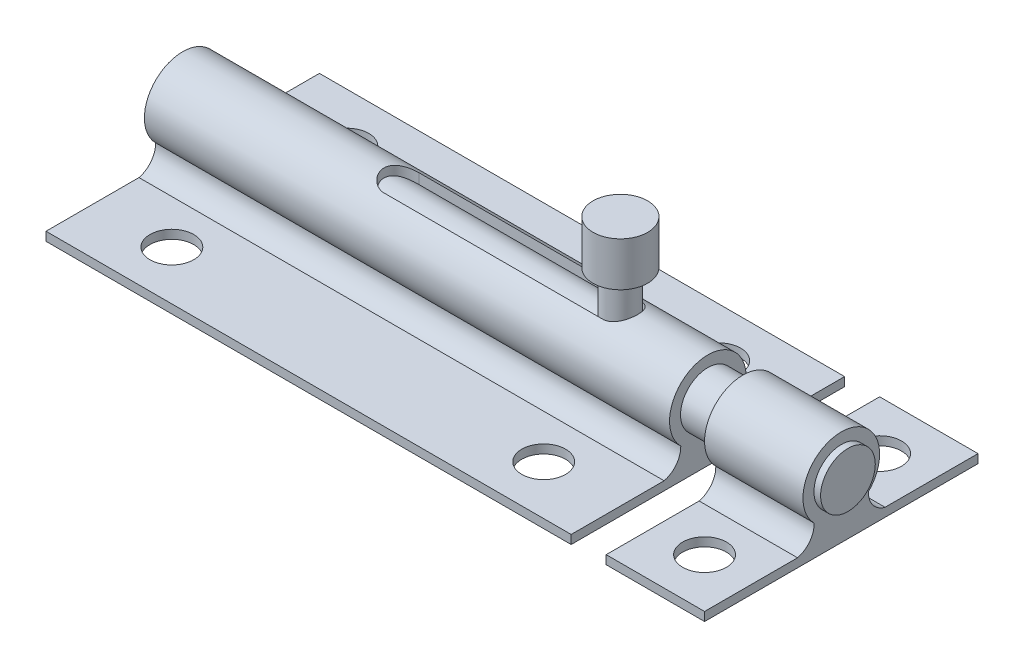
ISO-10303-21;
HEADER;
FILE_DESCRIPTION(('STEP AP214'),'2;1');
FILE_NAME('part.step','',(''),(''),'','','');
FILE_SCHEMA(('AUTOMOTIVE_DESIGN { 1 0 10303 214 1 1 1 1 }'));
ENDSEC;
DATA;
#1=APPLICATION_CONTEXT('core data for automotive mechanical design processes');
#2=APPLICATION_PROTOCOL_DEFINITION('international standard','automotive_design',2000,#1);
#3=PRODUCT_CONTEXT('',#1,'mechanical');
#4=PRODUCT('Part','Part','',(#3));
#5=PRODUCT_RELATED_PRODUCT_CATEGORY('part','',(#4));
#6=PRODUCT_DEFINITION_FORMATION('','',#4);
#7=PRODUCT_DEFINITION_CONTEXT('part definition',#1,'design');
#8=PRODUCT_DEFINITION('design','',#6,#7);
#9=PRODUCT_DEFINITION_SHAPE('','',#8);
#10=(LENGTH_UNIT() NAMED_UNIT(*) SI_UNIT(.MILLI.,.METRE.));
#11=(NAMED_UNIT(*) PLANE_ANGLE_UNIT() SI_UNIT($,.RADIAN.));
#12=(NAMED_UNIT(*) SI_UNIT($,.STERADIAN.) SOLID_ANGLE_UNIT());
#13=UNCERTAINTY_MEASURE_WITH_UNIT(LENGTH_MEASURE(1.E-05),#10,'distance_accuracy_value','');
#14=(GEOMETRIC_REPRESENTATION_CONTEXT(3) GLOBAL_UNCERTAINTY_ASSIGNED_CONTEXT((#13)) GLOBAL_UNIT_ASSIGNED_CONTEXT((#10,
#11,#12)) REPRESENTATION_CONTEXT('',''));
#15=CARTESIAN_POINT('',(0.,0.,0.));
#16=DIRECTION('',(0.,0.,1.));
#17=DIRECTION('',(1.,0.,0.));
#18=AXIS2_PLACEMENT_3D('',#15,#16,#17);
#19=CARTESIAN_POINT('',(38.1,8.3566,0.));
#20=DIRECTION('',(-1.,0.,0.));
#21=DIRECTION('',(0.,0.,1.));
#22=AXIS2_PLACEMENT_3D('',#19,#20,#21);
#23=CYLINDRICAL_SURFACE('',#22,5.5626);
#24=DIRECTION('',(-1.,0.,0.));
#25=VECTOR('',#24,1.);
#26=CARTESIAN_POINT('',(38.1,13.3054300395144,2.54));
#27=LINE('',#26,#25);
#28=CARTESIAN_POINT('',(25.4,13.3054300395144,2.54));
#29=VERTEX_POINT('',#28);
#30=CARTESIAN_POINT('',(-6.35,13.3054300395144,2.54));
#31=VERTEX_POINT('',#30);
#32=EDGE_CURVE('E196',#29,#31,#27,.T.);
#33=ORIENTED_EDGE('',*,*,#32,.T.);
#34=CARTESIAN_POINT('',(-6.35,13.3054300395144,2.54));
#35=CARTESIAN_POINT('',(-6.41736212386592,13.3054130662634,2.54001112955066));
#36=CARTESIAN_POINT('',(-6.48471493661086,13.3068049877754,2.53732063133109));
#37=CARTESIAN_POINT('',(-6.61885420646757,13.3122792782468,2.52662367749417));
#38=CARTESIAN_POINT('',(-6.68564093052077,13.3163602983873,2.51861988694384));
#39=CARTESIAN_POINT('',(-6.81784429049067,13.3270594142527,2.49743549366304));
#40=CARTESIAN_POINT('',(-6.88326603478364,13.3336649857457,2.48428043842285));
#41=CARTESIAN_POINT('',(-7.01260498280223,13.3491780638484,2.4529548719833));
#42=CARTESIAN_POINT('',(-7.07652205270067,13.3580857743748,2.43478391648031));
#43=CARTESIAN_POINT('',(-7.26517602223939,13.3878139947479,2.37307904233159));
#44=CARTESIAN_POINT('',(-7.38715003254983,13.4116689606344,2.32229853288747));
#45=CARTESIAN_POINT('',(-7.62092210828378,13.4647427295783,2.20309682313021));
#46=CARTESIAN_POINT('',(-7.73270694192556,13.4939683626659,2.13465311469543));
#47=CARTESIAN_POINT('',(-7.95120423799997,13.55689841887,1.9766422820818));
#48=CARTESIAN_POINT('',(-8.05706367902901,13.590772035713,1.8859603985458));
#49=CARTESIAN_POINT('',(-8.25269833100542,13.657799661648,1.68839524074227));
#50=CARTESIAN_POINT('',(-8.34246969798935,13.6909534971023,1.58150810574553));
#51=CARTESIAN_POINT('',(-8.50813498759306,13.7549617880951,1.34747394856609));
#52=CARTESIAN_POINT('',(-8.58301648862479,13.7855950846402,1.21954410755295));
#53=CARTESIAN_POINT('',(-8.70981142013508,13.8389633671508,0.951246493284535));
#54=CARTESIAN_POINT('',(-8.76173699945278,13.8617025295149,0.810885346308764));
#55=CARTESIAN_POINT('',(-8.83789391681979,13.8955027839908,0.530792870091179));
#56=CARTESIAN_POINT('',(-8.86362209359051,13.9071919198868,0.391545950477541));
#57=CARTESIAN_POINT('',(-8.89153346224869,13.9198855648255,0.110253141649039));
#58=CARTESIAN_POINT('',(-8.89372786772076,13.9208951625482,-0.0317913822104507));
#59=CARTESIAN_POINT('',(-8.87519885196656,13.9124527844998,-0.303596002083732));
#60=CARTESIAN_POINT('',(-8.85613276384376,13.9037573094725,-0.433497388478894));
#61=CARTESIAN_POINT('',(-8.79852239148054,13.8779693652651,-0.688016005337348));
#62=CARTESIAN_POINT('',(-8.75997702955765,13.8608764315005,-0.812632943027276));
#63=CARTESIAN_POINT('',(-8.66411459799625,13.8195801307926,-1.05535057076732));
#64=CARTESIAN_POINT('',(-8.60652282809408,13.7952732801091,-1.17332443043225));
#65=CARTESIAN_POINT('',(-8.47450918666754,13.74184082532,-1.39824289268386));
#66=CARTESIAN_POINT('',(-8.40008088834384,13.7127133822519,-1.50518326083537));
#67=CARTESIAN_POINT('',(-8.22944432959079,13.6496558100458,-1.71434229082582));
#68=CARTESIAN_POINT('',(-8.13194991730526,13.615527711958,-1.81545319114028));
#69=CARTESIAN_POINT('',(-7.92146067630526,13.5479850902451,-2.00043954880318));
#70=CARTESIAN_POINT('',(-7.80845559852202,13.5145710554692,-2.08430351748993));
#71=CARTESIAN_POINT('',(-7.56366003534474,13.450645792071,-2.2361409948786));
#72=CARTESIAN_POINT('',(-7.43124012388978,13.4203419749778,-2.30319354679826));
#73=CARTESIAN_POINT('',(-7.1553378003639,13.3687128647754,-2.41350276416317));
#74=CARTESIAN_POINT('',(-7.01187894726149,13.3473690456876,-2.45680858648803));
#75=CARTESIAN_POINT('',(-6.78083358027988,13.3234362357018,-2.50468207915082));
#76=CARTESIAN_POINT('',(-6.69537976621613,13.3167319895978,-2.51789035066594));
#77=CARTESIAN_POINT('',(-6.52330717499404,13.3077096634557,-2.53556033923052));
#78=CARTESIAN_POINT('',(-6.43668787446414,13.305393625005,-2.54001798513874));
#79=CARTESIAN_POINT('',(-6.35,13.3054300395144,-2.54));
#80=B_SPLINE_CURVE_WITH_KNOTS('',3,(#34,#35,#36,#37,#38,#39,#40,#41,#42,#43,#44,#45,#46,#47,#48,
#49,#50,#51,#52,#53,#54,#55,#56,#57,#58,#59,#60,#61,#62,#63,#64,#65,#66,#67,#68,#69,#70,#71,#72,
#73,#74,#75,#76,#77,#78,#79),.UNSPECIFIED.,.F.,.F.,(4,2,2,2,2,2,2,2,2,2,2,2,2,2,2,2,2,2,2,2,2,2,
4),(0.,0.202002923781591,0.403904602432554,0.604817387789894,0.805747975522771,1.20660184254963,
1.60796905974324,2.0364547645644,2.4650427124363,2.91679742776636,3.36831277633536,
3.79227078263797,4.21602676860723,4.60892309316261,5.00184115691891,5.40069309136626,
5.79969753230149,6.23144747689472,6.66348409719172,7.11562346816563,7.56682332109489,
7.82649440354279,8.08628626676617),.UNSPECIFIED.);
#81=CARTESIAN_POINT('',(-6.35,13.3054300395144,-2.54));
#82=VERTEX_POINT('',#81);
#83=EDGE_CURVE('E13',#31,#82,#80,.T.);
#84=ORIENTED_EDGE('',*,*,#83,.T.);
#85=DIRECTION('',(-1.,0.,0.));
#86=VECTOR('',#85,1.);
#87=CARTESIAN_POINT('',(38.1,13.3054300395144,-2.54));
#88=LINE('',#87,#86);
#89=CARTESIAN_POINT('',(25.4,13.3054300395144,-2.54));
#90=VERTEX_POINT('',#89);
#91=EDGE_CURVE('E48',#82,#90,#88,.F.);
#92=ORIENTED_EDGE('',*,*,#91,.T.);
#93=CARTESIAN_POINT('',(25.4,13.3054300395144,-2.54));
#94=CARTESIAN_POINT('',(25.4673621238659,13.3054130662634,-2.54001112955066));
#95=CARTESIAN_POINT('',(25.5347149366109,13.3068049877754,-2.53732063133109));
#96=CARTESIAN_POINT('',(25.6688542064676,13.3122792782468,-2.52662367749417));
#97=CARTESIAN_POINT('',(25.7356409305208,13.3163602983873,-2.51861988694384));
#98=CARTESIAN_POINT('',(25.8678442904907,13.3270594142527,-2.49743549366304));
#99=CARTESIAN_POINT('',(25.9332660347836,13.3336649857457,-2.48428043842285));
#100=CARTESIAN_POINT('',(26.0626049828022,13.3491780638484,-2.4529548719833));
#101=CARTESIAN_POINT('',(26.1265220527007,13.3580857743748,-2.43478391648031));
#102=CARTESIAN_POINT('',(26.3151760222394,13.3878139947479,-2.37307904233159));
#103=CARTESIAN_POINT('',(26.4371500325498,13.4116689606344,-2.32229853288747));
#104=CARTESIAN_POINT('',(26.6709221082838,13.4647427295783,-2.20309682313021));
#105=CARTESIAN_POINT('',(26.7827069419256,13.4939683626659,-2.13465311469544));
#106=CARTESIAN_POINT('',(27.001204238,13.55689841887,-1.9766422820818));
#107=CARTESIAN_POINT('',(27.107063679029,13.590772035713,-1.8859603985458));
#108=CARTESIAN_POINT('',(27.3026983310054,13.657799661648,-1.68839524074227));
#109=CARTESIAN_POINT('',(27.3924696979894,13.6909534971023,-1.58150810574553));
#110=CARTESIAN_POINT('',(27.5581349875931,13.7549617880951,-1.34747394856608));
#111=CARTESIAN_POINT('',(27.6330164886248,13.7855950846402,-1.21954410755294));
#112=CARTESIAN_POINT('',(27.7598114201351,13.8389633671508,-0.95124649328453));
#113=CARTESIAN_POINT('',(27.8117369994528,13.8617025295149,-0.81088534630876));
#114=CARTESIAN_POINT('',(27.8878939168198,13.8955027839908,-0.530792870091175));
#115=CARTESIAN_POINT('',(27.9136220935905,13.9071919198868,-0.391545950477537));
#116=CARTESIAN_POINT('',(27.9415334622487,13.9198855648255,-0.110253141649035));
#117=CARTESIAN_POINT('',(27.9437278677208,13.9208951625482,0.0317913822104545));
#118=CARTESIAN_POINT('',(27.9251988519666,13.9124527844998,0.303596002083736));
#119=CARTESIAN_POINT('',(27.9061327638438,13.9037573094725,0.433497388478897));
#120=CARTESIAN_POINT('',(27.8485223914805,13.8779693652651,0.688016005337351));
#121=CARTESIAN_POINT('',(27.8099770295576,13.8608764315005,0.812632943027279));
#122=CARTESIAN_POINT('',(27.7141145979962,13.8195801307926,1.05535057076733));
#123=CARTESIAN_POINT('',(27.6565228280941,13.7952732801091,1.17332443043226));
#124=CARTESIAN_POINT('',(27.5245091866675,13.74184082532,1.39824289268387));
#125=CARTESIAN_POINT('',(27.4500808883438,13.7127133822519,1.50518326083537));
#126=CARTESIAN_POINT('',(27.2794443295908,13.6496558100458,1.71434229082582));
#127=CARTESIAN_POINT('',(27.1819499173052,13.615527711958,1.81545319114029));
#128=CARTESIAN_POINT('',(26.9714606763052,13.5479850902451,2.00043954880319));
#129=CARTESIAN_POINT('',(26.858455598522,13.5145710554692,2.08430351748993));
#130=CARTESIAN_POINT('',(26.6136600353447,13.450645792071,2.2361409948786));
#131=CARTESIAN_POINT('',(26.4812401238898,13.4203419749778,2.30319354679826));
#132=CARTESIAN_POINT('',(26.2053378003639,13.3687128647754,2.41350276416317));
#133=CARTESIAN_POINT('',(26.0618789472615,13.3473690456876,2.45680858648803));
#134=CARTESIAN_POINT('',(25.8308335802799,13.3234362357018,2.50468207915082));
#135=CARTESIAN_POINT('',(25.7453797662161,13.3167319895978,2.51789035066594));
#136=CARTESIAN_POINT('',(25.573307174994,13.3077096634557,2.53556033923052));
#137=CARTESIAN_POINT('',(25.4866878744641,13.305393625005,2.54001798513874));
#138=CARTESIAN_POINT('',(25.4,13.3054300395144,2.54));
#139=B_SPLINE_CURVE_WITH_KNOTS('',3,(#93,#94,#95,#96,#97,#98,#99,#100,#101,#102,#103,#104,#105,
#106,#107,#108,#109,#110,#111,#112,#113,#114,#115,#116,#117,#118,#119,#120,#121,#122,#123,#124,
#125,#126,#127,#128,#129,#130,#131,#132,#133,#134,#135,#136,#137,#138),.UNSPECIFIED.,.F.,.F.,(4,
2,2,2,2,2,2,2,2,2,2,2,2,2,2,2,2,2,2,2,2,2,4),(0.,0.202002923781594,0.403904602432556,
0.604817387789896,0.805747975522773,1.20660184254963,1.60796905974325,2.03645476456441,
2.46504271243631,2.91679742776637,3.36831277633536,3.79227078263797,4.21602676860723,
4.60892309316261,5.00184115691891,5.40069309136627,5.79969753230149,6.23144747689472,
6.66348409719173,7.11562346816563,7.56682332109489,7.82649440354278,8.08628626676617),.UNSPECIFIED.);
#140=EDGE_CURVE('E238',#90,#29,#139,.T.);
#141=ORIENTED_EDGE('',*,*,#140,.T.);
#142=EDGE_LOOP('',(#33,#84,#92,#141));
#143=FACE_BOUND('',#142,.T.);
#144=CARTESIAN_POINT('',(-38.1,8.3566,0.));
#145=DIRECTION('',(1.,0.,0.));
#146=DIRECTION('',(0.,0.,-1.));
#147=AXIS2_PLACEMENT_3D('',#144,#145,#146);
#148=CIRCLE('',#147,5.5626);
#149=CARTESIAN_POINT('',(-38.1,4.42324781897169,-3.93335218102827));
#150=VERTEX_POINT('',#149);
#151=CARTESIAN_POINT('',(-38.1,4.42324781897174,3.93335218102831));
#152=VERTEX_POINT('',#151);
#153=EDGE_CURVE('E352',#150,#152,#148,.T.);
#154=ORIENTED_EDGE('',*,*,#153,.T.);
#155=DIRECTION('',(-1.,0.,0.));
#156=VECTOR('',#155,1.);
#157=CARTESIAN_POINT('',(38.1,4.42324781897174,3.93335218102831));
#158=LINE('',#157,#156);
#159=CARTESIAN_POINT('',(38.1,4.42324781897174,3.93335218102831));
#160=VERTEX_POINT('',#159);
#161=EDGE_CURVE('E492',#160,#152,#158,.T.);
#162=ORIENTED_EDGE('',*,*,#161,.F.);
#163=CARTESIAN_POINT('',(38.1,8.3566,0.));
#164=DIRECTION('',(1.,0.,0.));
#165=DIRECTION('',(0.,0.,-1.));
#166=AXIS2_PLACEMENT_3D('',#163,#164,#165);
#167=CIRCLE('',#166,5.5626);
#168=CARTESIAN_POINT('',(38.1,4.42324781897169,-3.93335218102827));
#169=VERTEX_POINT('',#168);
#170=EDGE_CURVE('E491',#169,#160,#167,.T.);
#171=ORIENTED_EDGE('',*,*,#170,.F.);
#172=DIRECTION('',(-1.,0.,0.));
#173=VECTOR('',#172,1.);
#174=CARTESIAN_POINT('',(38.1,4.42324781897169,-3.93335218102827));
#175=LINE('',#174,#173);
#176=EDGE_CURVE('E496',#169,#150,#175,.T.);
#177=ORIENTED_EDGE('',*,*,#176,.T.);
#178=EDGE_LOOP('',(#154,#162,#171,#177));
#179=FACE_BOUND('',#178,.T.);
#180=ADVANCED_FACE('F35',(#143,#179),#23,.T.);
#181=CARTESIAN_POINT('',(58.42,8.3566,0.));
#182=DIRECTION('',(-1.,0.,0.));
#183=DIRECTION('',(0.,0.,1.));
#184=AXIS2_PLACEMENT_3D('',#181,#182,#183);
#185=CYLINDRICAL_SURFACE('',#184,3.96875);
#186=CARTESIAN_POINT('',(38.1,8.3566,0.));
#187=DIRECTION('',(-1.,0.,0.));
#188=DIRECTION('',(0.,0.,1.));
#189=AXIS2_PLACEMENT_3D('',#186,#187,#188);
#190=CIRCLE('',#189,3.96875);
#191=CARTESIAN_POINT('',(38.1,8.3566,3.96875));
#192=VERTEX_POINT('',#191);
#193=EDGE_CURVE('E320',#192,#192,#190,.F.);
#194=ORIENTED_EDGE('',*,*,#193,.T.);
#195=EDGE_LOOP('',(#194));
#196=FACE_BOUND('',#195,.T.);
#197=CARTESIAN_POINT('',(43.18,8.3566,0.));
#198=DIRECTION('',(1.,0.,0.));
#199=DIRECTION('',(0.,0.,-1.));
#200=AXIS2_PLACEMENT_3D('',#197,#198,#199);
#201=CIRCLE('',#200,3.96875);
#202=CARTESIAN_POINT('',(43.18,8.3566,-3.96875));
#203=VERTEX_POINT('',#202);
#204=EDGE_CURVE('E367',#203,#203,#201,.T.);
#205=ORIENTED_EDGE('',*,*,#204,.F.);
#206=EDGE_LOOP('',(#205));
#207=FACE_BOUND('',#206,.T.);
#208=ADVANCED_FACE('F248',(#196,#207),#185,.T.);
#209=CARTESIAN_POINT('',(0.,1.27,0.));
#210=DIRECTION('',(0.,1.,0.));
#211=DIRECTION('',(0.,0.,1.));
#212=AXIS2_PLACEMENT_3D('',#209,#210,#211);
#213=PLANE('',#212);
#214=CARTESIAN_POINT('',(-26.9748,1.27,12.7));
#215=DIRECTION('',(0.,1.,0.));
#216=DIRECTION('',(0.,0.,1.));
#217=AXIS2_PLACEMENT_3D('',#214,#215,#216);
#218=CIRCLE('',#217,3.175);
#219=CARTESIAN_POINT('',(-26.9748,1.27,15.875));
#220=VERTEX_POINT('',#219);
#221=EDGE_CURVE('E387',#220,#220,#218,.T.);
#222=ORIENTED_EDGE('',*,*,#221,.F.);
#223=EDGE_LOOP('',(#222));
#224=FACE_BOUND('',#223,.T.);
#225=CARTESIAN_POINT('',(26.9748,1.27,12.7));
#226=DIRECTION('',(0.,1.,0.));
#227=DIRECTION('',(0.,0.,1.));
#228=AXIS2_PLACEMENT_3D('',#225,#226,#227);
#229=CIRCLE('',#228,3.175);
#230=CARTESIAN_POINT('',(26.9748,1.27,15.875));
#231=VERTEX_POINT('',#230);
#232=EDGE_CURVE('E394',#231,#231,#229,.T.);
#233=ORIENTED_EDGE('',*,*,#232,.F.);
#234=EDGE_LOOP('',(#233));
#235=FACE_BOUND('',#234,.T.);
#236=DIRECTION('',(0.,0.,-1.));
#237=VECTOR('',#236,1.);
#238=CARTESIAN_POINT('',(38.1,1.27,-19.8374));
#239=LINE('',#238,#237);
#240=CARTESIAN_POINT('',(38.1,1.27,19.8374));
#241=VERTEX_POINT('',#240);
#242=CARTESIAN_POINT('',(38.1,1.27,6.35));
#243=VERTEX_POINT('',#242);
#244=EDGE_CURVE('E304',#241,#243,#239,.T.);
#245=ORIENTED_EDGE('',*,*,#244,.T.);
#246=DIRECTION('',(-1.,0.,0.));
#247=VECTOR('',#246,1.);
#248=CARTESIAN_POINT('',(38.1,1.27,6.35));
#249=LINE('',#248,#247);
#250=CARTESIAN_POINT('',(-38.1,1.27,6.35));
#251=VERTEX_POINT('',#250);
#252=EDGE_CURVE('E500',#243,#251,#249,.T.);
#253=ORIENTED_EDGE('',*,*,#252,.T.);
#254=DIRECTION('',(0.,0.,1.));
#255=VECTOR('',#254,1.);
#256=CARTESIAN_POINT('',(-38.1,1.27,-19.8374));
#257=LINE('',#256,#255);
#258=CARTESIAN_POINT('',(-38.1,1.27,19.8374));
#259=VERTEX_POINT('',#258);
#260=EDGE_CURVE('E310',#251,#259,#257,.T.);
#261=ORIENTED_EDGE('',*,*,#260,.T.);
#262=DIRECTION('',(1.,0.,0.));
#263=VECTOR('',#262,1.);
#264=CARTESIAN_POINT('',(-38.1,1.27,19.8374));
#265=LINE('',#264,#263);
#266=EDGE_CURVE('E325',#259,#241,#265,.T.);
#267=ORIENTED_EDGE('',*,*,#266,.T.);
#268=EDGE_LOOP('',(#245,#253,#261,#267));
#269=FACE_BOUND('',#268,.T.);
#270=ADVANCED_FACE('F267',(#224,#235,#269),#213,.T.);
#271=CARTESIAN_POINT('',(-38.1,1.27,-19.8374));
#272=DIRECTION('',(1.,0.,0.));
#273=DIRECTION('',(0.,0.,-1.));
#274=AXIS2_PLACEMENT_3D('',#271,#272,#273);
#275=PLANE('',#274);
#276=CARTESIAN_POINT('',(-38.1,8.3566,0.));
#277=DIRECTION('',(-1.,0.,0.));
#278=DIRECTION('',(0.,0.,1.));
#279=AXIS2_PLACEMENT_3D('',#276,#277,#278);
#280=CIRCLE('',#279,3.96875);
#281=CARTESIAN_POINT('',(-38.1,8.3566,3.96875));
#282=VERTEX_POINT('',#281);
#283=EDGE_CURVE('E388',#282,#282,#280,.T.);
#284=ORIENTED_EDGE('',*,*,#283,.F.);
#285=EDGE_LOOP('',(#284));
#286=FACE_BOUND('',#285,.T.);
#287=DIRECTION('',(0.,0.,1.));
#288=VECTOR('',#287,1.);
#289=CARTESIAN_POINT('',(-38.1,0.,-19.8374));
#290=LINE('',#289,#288);
#291=CARTESIAN_POINT('',(-38.1,0.,-19.8374));
#292=VERTEX_POINT('',#291);
#293=CARTESIAN_POINT('',(-38.1,0.,19.8374));
#294=VERTEX_POINT('',#293);
#295=EDGE_CURVE('E298',#292,#294,#290,.T.);
#296=ORIENTED_EDGE('',*,*,#295,.T.);
#297=DIRECTION('',(0.,-1.,0.));
#298=VECTOR('',#297,1.);
#299=CARTESIAN_POINT('',(-38.1,1.27,19.8374));
#300=LINE('',#299,#298);
#301=EDGE_CURVE('E292',#259,#294,#300,.T.);
#302=ORIENTED_EDGE('',*,*,#301,.F.);
#303=ORIENTED_EDGE('',*,*,#260,.F.);
#304=CARTESIAN_POINT('',(-38.1,4.35329294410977,7.10758142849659));
#305=DIRECTION('',(-1.,0.,0.));
#306=DIRECTION('',(0.,0.,-1.));
#307=AXIS2_PLACEMENT_3D('',#304,#305,#306);
#308=CIRCLE('',#307,3.175);
#309=EDGE_CURVE('E63',#152,#251,#308,.T.);
#310=ORIENTED_EDGE('',*,*,#309,.F.);
#311=ORIENTED_EDGE('',*,*,#153,.F.);
#312=CARTESIAN_POINT('',(-38.1,4.35329294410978,-7.10758142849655));
#313=DIRECTION('',(-1.,0.,0.));
#314=DIRECTION('',(0.,0.,-1.));
#315=AXIS2_PLACEMENT_3D('',#312,#313,#314);
#316=CIRCLE('',#315,3.175);
#317=CARTESIAN_POINT('',(-38.1,1.27,-6.35));
#318=VERTEX_POINT('',#317);
#319=EDGE_CURVE('E351',#318,#150,#316,.T.);
#320=ORIENTED_EDGE('',*,*,#319,.F.);
#321=CARTESIAN_POINT('',(-38.1,1.27,-19.8374));
#322=VERTEX_POINT('',#321);
#323=EDGE_CURVE('E321',#322,#318,#257,.T.);
#324=ORIENTED_EDGE('',*,*,#323,.F.);
#325=DIRECTION('',(0.,-1.,0.));
#326=VECTOR('',#325,1.);
#327=CARTESIAN_POINT('',(-38.1,1.27,-19.8374));
#328=LINE('',#327,#326);
#329=EDGE_CURVE('E314',#322,#292,#328,.T.);
#330=ORIENTED_EDGE('',*,*,#329,.T.);
#331=EDGE_LOOP('',(#296,#302,#303,#310,#311,#320,#324,#330));
#332=FACE_BOUND('',#331,.T.);
#333=ADVANCED_FACE('F37',(#286,#332),#275,.F.);
#334=CARTESIAN_POINT('',(-38.1,1.27,19.8374));
#335=DIRECTION('',(0.,0.,-1.));
#336=DIRECTION('',(-1.,0.,0.));
#337=AXIS2_PLACEMENT_3D('',#334,#335,#336);
#338=PLANE('',#337);
#339=DIRECTION('',(1.,0.,0.));
#340=VECTOR('',#339,1.);
#341=CARTESIAN_POINT('',(-38.1,0.,19.8374));
#342=LINE('',#341,#340);
#343=CARTESIAN_POINT('',(38.1,0.,19.8374));
#344=VERTEX_POINT('',#343);
#345=EDGE_CURVE('E286',#294,#344,#342,.T.);
#346=ORIENTED_EDGE('',*,*,#345,.T.);
#347=DIRECTION('',(0.,-1.,0.));
#348=VECTOR('',#347,1.);
#349=CARTESIAN_POINT('',(38.1,1.27,19.8374));
#350=LINE('',#349,#348);
#351=EDGE_CURVE('E289',#241,#344,#350,.T.);
#352=ORIENTED_EDGE('',*,*,#351,.F.);
#353=ORIENTED_EDGE('',*,*,#266,.F.);
#354=ORIENTED_EDGE('',*,*,#301,.T.);
#355=EDGE_LOOP('',(#346,#352,#353,#354));
#356=FACE_BOUND('',#355,.T.);
#357=ADVANCED_FACE('F276',(#356),#338,.F.);
#358=CARTESIAN_POINT('',(38.1,1.27,-19.8374));
#359=DIRECTION('',(-1.,0.,0.));
#360=DIRECTION('',(0.,0.,1.));
#361=AXIS2_PLACEMENT_3D('',#358,#359,#360);
#362=PLANE('',#361);
#363=ORIENTED_EDGE('',*,*,#193,.F.);
#364=EDGE_LOOP('',(#363));
#365=FACE_BOUND('',#364,.T.);
#366=DIRECTION('',(0.,0.,-1.));
#367=VECTOR('',#366,1.);
#368=CARTESIAN_POINT('',(38.1,0.,-19.8374));
#369=LINE('',#368,#367);
#370=CARTESIAN_POINT('',(38.1,0.,-19.8374));
#371=VERTEX_POINT('',#370);
#372=EDGE_CURVE('E297',#344,#371,#369,.T.);
#373=ORIENTED_EDGE('',*,*,#372,.T.);
#374=DIRECTION('',(0.,-1.,0.));
#375=VECTOR('',#374,1.);
#376=CARTESIAN_POINT('',(38.1,1.27,-19.8374));
#377=LINE('',#376,#375);
#378=CARTESIAN_POINT('',(38.1,1.27,-19.8374));
#379=VERTEX_POINT('',#378);
#380=EDGE_CURVE('E305',#379,#371,#377,.T.);
#381=ORIENTED_EDGE('',*,*,#380,.F.);
#382=CARTESIAN_POINT('',(38.1,1.27,-6.35));
#383=VERTEX_POINT('',#382);
#384=EDGE_CURVE('E334',#383,#379,#239,.T.);
#385=ORIENTED_EDGE('',*,*,#384,.F.);
#386=CARTESIAN_POINT('',(38.1,4.35329294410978,-7.10758142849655));
#387=DIRECTION('',(-1.,0.,0.));
#388=DIRECTION('',(0.,0.,-1.));
#389=AXIS2_PLACEMENT_3D('',#386,#387,#388);
#390=CIRCLE('',#389,3.175);
#391=EDGE_CURVE('E493',#383,#169,#390,.T.);
#392=ORIENTED_EDGE('',*,*,#391,.T.);
#393=ORIENTED_EDGE('',*,*,#170,.T.);
#394=CARTESIAN_POINT('',(38.1,4.35329294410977,7.10758142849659));
#395=DIRECTION('',(-1.,0.,0.));
#396=DIRECTION('',(0.,0.,-1.));
#397=AXIS2_PLACEMENT_3D('',#394,#395,#396);
#398=CIRCLE('',#397,3.175);
#399=EDGE_CURVE('E356',#160,#243,#398,.T.);
#400=ORIENTED_EDGE('',*,*,#399,.T.);
#401=ORIENTED_EDGE('',*,*,#244,.F.);
#402=ORIENTED_EDGE('',*,*,#351,.T.);
#403=EDGE_LOOP('',(#373,#381,#385,#392,#393,#400,#401,#402));
#404=FACE_BOUND('',#403,.T.);
#405=ADVANCED_FACE('F273',(#365,#404),#362,.F.);
#406=CARTESIAN_POINT('',(-38.1,1.27,-19.8374));
#407=DIRECTION('',(0.,0.,1.));
#408=DIRECTION('',(1.,0.,0.));
#409=AXIS2_PLACEMENT_3D('',#406,#407,#408);
#410=PLANE('',#409);
#411=DIRECTION('',(-1.,0.,0.));
#412=VECTOR('',#411,1.);
#413=CARTESIAN_POINT('',(-38.1,0.,-19.8374));
#414=LINE('',#413,#412);
#415=EDGE_CURVE('E308',#371,#292,#414,.T.);
#416=ORIENTED_EDGE('',*,*,#415,.T.);
#417=ORIENTED_EDGE('',*,*,#329,.F.);
#418=DIRECTION('',(-1.,0.,0.));
#419=VECTOR('',#418,1.);
#420=CARTESIAN_POINT('',(-38.1,1.27,-19.8374));
#421=LINE('',#420,#419);
#422=EDGE_CURVE('E317',#379,#322,#421,.T.);
#423=ORIENTED_EDGE('',*,*,#422,.F.);
#424=ORIENTED_EDGE('',*,*,#380,.T.);
#425=EDGE_LOOP('',(#416,#417,#423,#424));
#426=FACE_BOUND('',#425,.T.);
#427=ADVANCED_FACE('F265',(#426),#410,.F.);
#428=CARTESIAN_POINT('',(26.9748,1.27,-12.7));
#429=DIRECTION('',(0.,1.,0.));
#430=DIRECTION('',(0.,0.,1.));
#431=AXIS2_PLACEMENT_3D('',#428,#429,#430);
#432=CIRCLE('',#431,3.175);
#433=CARTESIAN_POINT('',(26.9748,1.27,-9.525));
#434=VERTEX_POINT('',#433);
#435=EDGE_CURVE('E412',#434,#434,#432,.T.);
#436=ORIENTED_EDGE('',*,*,#435,.F.);
#437=EDGE_LOOP('',(#436));
#438=FACE_BOUND('',#437,.T.);
#439=CARTESIAN_POINT('',(-26.9748,1.27,-12.7));
#440=DIRECTION('',(0.,1.,0.));
#441=DIRECTION('',(0.,0.,1.));
#442=AXIS2_PLACEMENT_3D('',#439,#440,#441);
#443=CIRCLE('',#442,3.175);
#444=CARTESIAN_POINT('',(-26.9748,1.27,-9.525));
#445=VERTEX_POINT('',#444);
#446=EDGE_CURVE('E418',#445,#445,#443,.T.);
#447=ORIENTED_EDGE('',*,*,#446,.F.);
#448=EDGE_LOOP('',(#447));
#449=FACE_BOUND('',#448,.T.);
#450=DIRECTION('',(-1.,0.,0.));
#451=VECTOR('',#450,1.);
#452=CARTESIAN_POINT('',(38.1,1.27,-6.35));
#453=LINE('',#452,#451);
#454=EDGE_CURVE('E346',#383,#318,#453,.T.);
#455=ORIENTED_EDGE('',*,*,#454,.F.);
#456=ORIENTED_EDGE('',*,*,#384,.T.);
#457=ORIENTED_EDGE('',*,*,#422,.T.);
#458=ORIENTED_EDGE('',*,*,#323,.T.);
#459=EDGE_LOOP('',(#455,#456,#457,#458));
#460=FACE_BOUND('',#459,.T.);
#461=ADVANCED_FACE('F262',(#438,#449,#460),#213,.T.);
#462=CARTESIAN_POINT('',(0.,0.,0.));
#463=DIRECTION('',(0.,1.,0.));
#464=DIRECTION('',(0.,0.,1.));
#465=AXIS2_PLACEMENT_3D('',#462,#463,#464);
#466=PLANE('',#465);
#467=CARTESIAN_POINT('',(-26.9748,0.,12.7));
#468=DIRECTION('',(0.,1.,0.));
#469=DIRECTION('',(0.,0.,1.));
#470=AXIS2_PLACEMENT_3D('',#467,#468,#469);
#471=CIRCLE('',#470,3.175);
#472=CARTESIAN_POINT('',(-26.9748,0.,15.875));
#473=VERTEX_POINT('',#472);
#474=EDGE_CURVE('E391',#473,#473,#471,.T.);
#475=ORIENTED_EDGE('',*,*,#474,.T.);
#476=EDGE_LOOP('',(#475));
#477=FACE_BOUND('',#476,.T.);
#478=CARTESIAN_POINT('',(26.9748,0.,12.7));
#479=DIRECTION('',(0.,1.,0.));
#480=DIRECTION('',(0.,0.,1.));
#481=AXIS2_PLACEMENT_3D('',#478,#479,#480);
#482=CIRCLE('',#481,3.175);
#483=CARTESIAN_POINT('',(26.9748,0.,15.875));
#484=VERTEX_POINT('',#483);
#485=EDGE_CURVE('E397',#484,#484,#482,.T.);
#486=ORIENTED_EDGE('',*,*,#485,.T.);
#487=EDGE_LOOP('',(#486));
#488=FACE_BOUND('',#487,.T.);
#489=CARTESIAN_POINT('',(26.9748,0.,-12.7));
#490=DIRECTION('',(0.,1.,0.));
#491=DIRECTION('',(0.,0.,1.));
#492=AXIS2_PLACEMENT_3D('',#489,#490,#491);
#493=CIRCLE('',#492,3.175);
#494=CARTESIAN_POINT('',(26.9748,0.,-9.525));
#495=VERTEX_POINT('',#494);
#496=EDGE_CURVE('E415',#495,#495,#493,.T.);
#497=ORIENTED_EDGE('',*,*,#496,.T.);
#498=EDGE_LOOP('',(#497));
#499=FACE_BOUND('',#498,.T.);
#500=CARTESIAN_POINT('',(-26.9748,0.,-12.7));
#501=DIRECTION('',(0.,1.,0.));
#502=DIRECTION('',(0.,0.,1.));
#503=AXIS2_PLACEMENT_3D('',#500,#501,#502);
#504=CIRCLE('',#503,3.175);
#505=CARTESIAN_POINT('',(-26.9748,0.,-9.525));
#506=VERTEX_POINT('',#505);
#507=EDGE_CURVE('E421',#506,#506,#504,.T.);
#508=ORIENTED_EDGE('',*,*,#507,.T.);
#509=EDGE_LOOP('',(#508));
#510=FACE_BOUND('',#509,.T.);
#511=ORIENTED_EDGE('',*,*,#295,.F.);
#512=ORIENTED_EDGE('',*,*,#415,.F.);
#513=ORIENTED_EDGE('',*,*,#372,.F.);
#514=ORIENTED_EDGE('',*,*,#345,.F.);
#515=EDGE_LOOP('',(#511,#512,#513,#514));
#516=FACE_BOUND('',#515,.T.);
#517=ADVANCED_FACE('F261',(#477,#488,#499,#510,#516),#466,.F.);
#518=CARTESIAN_POINT('',(38.1,4.35329294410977,7.10758142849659));
#519=DIRECTION('',(-1.,0.,0.));
#520=DIRECTION('',(0.,0.,1.));
#521=AXIS2_PLACEMENT_3D('',#518,#519,#520);
#522=CYLINDRICAL_SURFACE('',#521,3.175);
#523=ORIENTED_EDGE('',*,*,#309,.T.);
#524=ORIENTED_EDGE('',*,*,#252,.F.);
#525=ORIENTED_EDGE('',*,*,#399,.F.);
#526=ORIENTED_EDGE('',*,*,#161,.T.);
#527=EDGE_LOOP('',(#523,#524,#525,#526));
#528=FACE_BOUND('',#527,.T.);
#529=ADVANCED_FACE('F257',(#528),#522,.F.);
#530=CARTESIAN_POINT('',(38.1,4.35329294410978,-7.10758142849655));
#531=DIRECTION('',(-1.,0.,0.));
#532=DIRECTION('',(0.,0.,1.));
#533=AXIS2_PLACEMENT_3D('',#530,#531,#532);
#534=CYLINDRICAL_SURFACE('',#533,3.175);
#535=ORIENTED_EDGE('',*,*,#319,.T.);
#536=ORIENTED_EDGE('',*,*,#176,.F.);
#537=ORIENTED_EDGE('',*,*,#391,.F.);
#538=ORIENTED_EDGE('',*,*,#454,.T.);
#539=EDGE_LOOP('',(#535,#536,#537,#538));
#540=FACE_BOUND('',#539,.T.);
#541=ADVANCED_FACE('F252',(#540),#534,.F.);
#542=CARTESIAN_POINT('',(57.4548,1.27,19.8374));
#543=DIRECTION('',(0.,0.,-1.));
#544=DIRECTION('',(-1.,0.,0.));
#545=AXIS2_PLACEMENT_3D('',#542,#543,#544);
#546=PLANE('',#545);
#547=DIRECTION('',(0.,-1.,0.));
#548=VECTOR('',#547,1.);
#549=CARTESIAN_POINT('',(43.18,1.27,19.8374));
#550=LINE('',#549,#548);
#551=CARTESIAN_POINT('',(43.18,1.27,19.8374));
#552=VERTEX_POINT('',#551);
#553=CARTESIAN_POINT('',(43.18,0.,19.8374));
#554=VERTEX_POINT('',#553);
#555=EDGE_CURVE('E430',#552,#554,#550,.T.);
#556=ORIENTED_EDGE('',*,*,#555,.T.);
#557=DIRECTION('',(-1.,0.,0.));
#558=VECTOR('',#557,1.);
#559=CARTESIAN_POINT('',(57.4548,0.,19.8374));
#560=LINE('',#559,#558);
#561=CARTESIAN_POINT('',(57.4548,0.,19.8374));
#562=VERTEX_POINT('',#561);
#563=EDGE_CURVE('E373',#562,#554,#560,.T.);
#564=ORIENTED_EDGE('',*,*,#563,.F.);
#565=DIRECTION('',(0.,-1.,0.));
#566=VECTOR('',#565,1.);
#567=CARTESIAN_POINT('',(57.4548,1.27,19.8374));
#568=LINE('',#567,#566);
#569=CARTESIAN_POINT('',(57.4548,1.27,19.8374));
#570=VERTEX_POINT('',#569);
#571=EDGE_CURVE('E433',#570,#562,#568,.T.);
#572=ORIENTED_EDGE('',*,*,#571,.F.);
#573=DIRECTION('',(-1.,0.,0.));
#574=VECTOR('',#573,1.);
#575=CARTESIAN_POINT('',(57.4548,1.27,19.8374));
#576=LINE('',#575,#574);
#577=EDGE_CURVE('E451',#570,#552,#576,.T.);
#578=ORIENTED_EDGE('',*,*,#577,.T.);
#579=EDGE_LOOP('',(#556,#564,#572,#578));
#580=FACE_BOUND('',#579,.T.);
#581=ADVANCED_FACE('F256',(#580),#546,.F.);
#582=CARTESIAN_POINT('',(57.4548,0.,19.8374));
#583=DIRECTION('',(0.,1.,0.));
#584=DIRECTION('',(0.,0.,1.));
#585=AXIS2_PLACEMENT_3D('',#582,#583,#584);
#586=PLANE('',#585);
#587=CARTESIAN_POINT('',(50.3174,0.,12.7));
#588=DIRECTION('',(0.,1.,0.));
#589=DIRECTION('',(0.,0.,1.));
#590=AXIS2_PLACEMENT_3D('',#587,#588,#589);
#591=CIRCLE('',#590,3.175);
#592=CARTESIAN_POINT('',(50.3174,0.,15.875));
#593=VERTEX_POINT('',#592);
#594=EDGE_CURVE('E403',#593,#593,#591,.T.);
#595=ORIENTED_EDGE('',*,*,#594,.T.);
#596=EDGE_LOOP('',(#595));
#597=FACE_BOUND('',#596,.T.);
#598=CARTESIAN_POINT('',(50.3174,0.,-12.7));
#599=DIRECTION('',(0.,1.,0.));
#600=DIRECTION('',(0.,0.,1.));
#601=AXIS2_PLACEMENT_3D('',#598,#599,#600);
#602=CIRCLE('',#601,3.175);
#603=CARTESIAN_POINT('',(50.3174,0.,-9.525));
#604=VERTEX_POINT('',#603);
#605=EDGE_CURVE('E409',#604,#604,#602,.T.);
#606=ORIENTED_EDGE('',*,*,#605,.T.);
#607=EDGE_LOOP('',(#606));
#608=FACE_BOUND('',#607,.T.);
#609=DIRECTION('',(0.,0.,-1.));
#610=VECTOR('',#609,1.);
#611=CARTESIAN_POINT('',(43.18,0.,19.8374));
#612=LINE('',#611,#610);
#613=CARTESIAN_POINT('',(43.18,0.,-19.8374));
#614=VERTEX_POINT('',#613);
#615=EDGE_CURVE('E454',#554,#614,#612,.T.);
#616=ORIENTED_EDGE('',*,*,#615,.T.);
#617=DIRECTION('',(-1.,0.,0.));
#618=VECTOR('',#617,1.);
#619=CARTESIAN_POINT('',(57.4548,0.,-19.8374));
#620=LINE('',#619,#618);
#621=CARTESIAN_POINT('',(57.4548,0.,-19.8374));
#622=VERTEX_POINT('',#621);
#623=EDGE_CURVE('E484',#622,#614,#620,.T.);
#624=ORIENTED_EDGE('',*,*,#623,.F.);
#625=DIRECTION('',(0.,0.,-1.));
#626=VECTOR('',#625,1.);
#627=CARTESIAN_POINT('',(57.4548,0.,19.8374));
#628=LINE('',#627,#626);
#629=EDGE_CURVE('E436',#562,#622,#628,.T.);
#630=ORIENTED_EDGE('',*,*,#629,.F.);
#631=ORIENTED_EDGE('',*,*,#563,.T.);
#632=EDGE_LOOP('',(#616,#624,#630,#631));
#633=FACE_BOUND('',#632,.T.);
#634=ADVANCED_FACE('F593',(#597,#608,#633),#586,.F.);
#635=CARTESIAN_POINT('',(57.4548,0.,-19.8374));
#636=DIRECTION('',(0.,0.,1.));
#637=DIRECTION('',(1.,0.,0.));
#638=AXIS2_PLACEMENT_3D('',#635,#636,#637);
#639=PLANE('',#638);
#640=DIRECTION('',(0.,1.,0.));
#641=VECTOR('',#640,1.);
#642=CARTESIAN_POINT('',(43.18,0.,-19.8374));
#643=LINE('',#642,#641);
#644=CARTESIAN_POINT('',(43.18,1.27,-19.8374));
#645=VERTEX_POINT('',#644);
#646=EDGE_CURVE('E456',#614,#645,#643,.T.);
#647=ORIENTED_EDGE('',*,*,#646,.T.);
#648=DIRECTION('',(-1.,0.,0.));
#649=VECTOR('',#648,1.);
#650=CARTESIAN_POINT('',(57.4548,1.27,-19.8374));
#651=LINE('',#650,#649);
#652=CARTESIAN_POINT('',(57.4548,1.27,-19.8374));
#653=VERTEX_POINT('',#652);
#654=EDGE_CURVE('E481',#653,#645,#651,.T.);
#655=ORIENTED_EDGE('',*,*,#654,.F.);
#656=DIRECTION('',(0.,1.,0.));
#657=VECTOR('',#656,1.);
#658=CARTESIAN_POINT('',(57.4548,0.,-19.8374));
#659=LINE('',#658,#657);
#660=EDGE_CURVE('E439',#622,#653,#659,.T.);
#661=ORIENTED_EDGE('',*,*,#660,.F.);
#662=ORIENTED_EDGE('',*,*,#623,.T.);
#663=EDGE_LOOP('',(#647,#655,#661,#662));
#664=FACE_BOUND('',#663,.T.);
#665=ADVANCED_FACE('F589',(#664),#639,.F.);
#666=CARTESIAN_POINT('',(57.4548,1.27,-19.8374));
#667=DIRECTION('',(0.,-1.,0.));
#668=DIRECTION('',(0.,0.,-1.));
#669=AXIS2_PLACEMENT_3D('',#666,#667,#668);
#670=PLANE('',#669);
#671=CARTESIAN_POINT('',(50.3174,1.27,-12.7));
#672=DIRECTION('',(0.,1.,0.));
#673=DIRECTION('',(0.,0.,1.));
#674=AXIS2_PLACEMENT_3D('',#671,#672,#673);
#675=CIRCLE('',#674,3.175);
#676=CARTESIAN_POINT('',(50.3174,1.27,-9.525));
#677=VERTEX_POINT('',#676);
#678=EDGE_CURVE('E406',#677,#677,#675,.T.);
#679=ORIENTED_EDGE('',*,*,#678,.F.);
#680=EDGE_LOOP('',(#679));
#681=FACE_BOUND('',#680,.T.);
#682=DIRECTION('',(0.,0.,1.));
#683=VECTOR('',#682,1.);
#684=CARTESIAN_POINT('',(43.18,1.27,-19.8374));
#685=LINE('',#684,#683);
#686=CARTESIAN_POINT('',(43.18,1.27,-6.35));
#687=VERTEX_POINT('',#686);
#688=EDGE_CURVE('E458',#645,#687,#685,.T.);
#689=ORIENTED_EDGE('',*,*,#688,.T.);
#690=DIRECTION('',(-1.,0.,0.));
#691=VECTOR('',#690,1.);
#692=CARTESIAN_POINT('',(57.4548,1.27,-6.35));
#693=LINE('',#692,#691);
#694=CARTESIAN_POINT('',(57.4548,1.27,-6.35));
#695=VERTEX_POINT('',#694);
#696=EDGE_CURVE('E478',#695,#687,#693,.T.);
#697=ORIENTED_EDGE('',*,*,#696,.F.);
#698=DIRECTION('',(0.,0.,1.));
#699=VECTOR('',#698,1.);
#700=CARTESIAN_POINT('',(57.4548,1.27,-19.8374));
#701=LINE('',#700,#699);
#702=EDGE_CURVE('E441',#653,#695,#701,.T.);
#703=ORIENTED_EDGE('',*,*,#702,.F.);
#704=ORIENTED_EDGE('',*,*,#654,.T.);
#705=EDGE_LOOP('',(#689,#697,#703,#704));
#706=FACE_BOUND('',#705,.T.);
#707=ADVANCED_FACE('F585',(#681,#706),#670,.F.);
#708=CARTESIAN_POINT('',(57.4548,4.35329294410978,-7.10758142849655));
#709=DIRECTION('',(-1.,0.,0.));
#710=DIRECTION('',(0.,0.,1.));
#711=AXIS2_PLACEMENT_3D('',#708,#709,#710);
#712=CYLINDRICAL_SURFACE('',#711,3.175);
#713=CARTESIAN_POINT('',(43.18,4.35329294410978,-7.10758142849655));
#714=DIRECTION('',(-1.,0.,0.));
#715=DIRECTION('',(0.,0.,-1.));
#716=AXIS2_PLACEMENT_3D('',#713,#714,#715);
#717=CIRCLE('',#716,3.175);
#718=CARTESIAN_POINT('',(43.18,4.42324781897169,-3.93335218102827));
#719=VERTEX_POINT('',#718);
#720=EDGE_CURVE('E460',#687,#719,#717,.T.);
#721=ORIENTED_EDGE('',*,*,#720,.T.);
#722=DIRECTION('',(-1.,0.,0.));
#723=VECTOR('',#722,1.);
#724=CARTESIAN_POINT('',(57.4548,4.42324781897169,-3.93335218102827));
#725=LINE('',#724,#723);
#726=CARTESIAN_POINT('',(57.4548,4.42324781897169,-3.93335218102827));
#727=VERTEX_POINT('',#726);
#728=EDGE_CURVE('E475',#727,#719,#725,.T.);
#729=ORIENTED_EDGE('',*,*,#728,.F.);
#730=CARTESIAN_POINT('',(57.4548,4.35329294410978,-7.10758142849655));
#731=DIRECTION('',(-1.,0.,0.));
#732=DIRECTION('',(0.,0.,-1.));
#733=AXIS2_PLACEMENT_3D('',#730,#731,#732);
#734=CIRCLE('',#733,3.175);
#735=EDGE_CURVE('E443',#695,#727,#734,.T.);
#736=ORIENTED_EDGE('',*,*,#735,.F.);
#737=ORIENTED_EDGE('',*,*,#696,.T.);
#738=EDGE_LOOP('',(#721,#729,#736,#737));
#739=FACE_BOUND('',#738,.T.);
#740=ADVANCED_FACE('F581',(#739),#712,.F.);
#741=CARTESIAN_POINT('',(57.4548,8.3566,0.));
#742=DIRECTION('',(-1.,0.,0.));
#743=DIRECTION('',(0.,0.,1.));
#744=AXIS2_PLACEMENT_3D('',#741,#742,#743);
#745=CYLINDRICAL_SURFACE('',#744,5.5626);
#746=CARTESIAN_POINT('',(43.18,8.3566,0.));
#747=DIRECTION('',(1.,0.,0.));
#748=DIRECTION('',(0.,0.,-1.));
#749=AXIS2_PLACEMENT_3D('',#746,#747,#748);
#750=CIRCLE('',#749,5.5626);
#751=CARTESIAN_POINT('',(43.18,4.42324781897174,3.93335218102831));
#752=VERTEX_POINT('',#751);
#753=EDGE_CURVE('E462',#719,#752,#750,.T.);
#754=ORIENTED_EDGE('',*,*,#753,.T.);
#755=DIRECTION('',(-1.,0.,0.));
#756=VECTOR('',#755,1.);
#757=CARTESIAN_POINT('',(57.4548,4.42324781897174,3.93335218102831));
#758=LINE('',#757,#756);
#759=CARTESIAN_POINT('',(57.4548,4.42324781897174,3.93335218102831));
#760=VERTEX_POINT('',#759);
#761=EDGE_CURVE('E472',#760,#752,#758,.T.);
#762=ORIENTED_EDGE('',*,*,#761,.F.);
#763=CARTESIAN_POINT('',(57.4548,8.3566,0.));
#764=DIRECTION('',(1.,0.,0.));
#765=DIRECTION('',(0.,0.,-1.));
#766=AXIS2_PLACEMENT_3D('',#763,#764,#765);
#767=CIRCLE('',#766,5.5626);
#768=EDGE_CURVE('E445',#727,#760,#767,.T.);
#769=ORIENTED_EDGE('',*,*,#768,.F.);
#770=ORIENTED_EDGE('',*,*,#728,.T.);
#771=EDGE_LOOP('',(#754,#762,#769,#770));
#772=FACE_BOUND('',#771,.T.);
#773=ADVANCED_FACE('F577',(#772),#745,.T.);
#774=CARTESIAN_POINT('',(57.4548,4.35329294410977,7.10758142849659));
#775=DIRECTION('',(-1.,0.,0.));
#776=DIRECTION('',(0.,0.,1.));
#777=AXIS2_PLACEMENT_3D('',#774,#775,#776);
#778=CYLINDRICAL_SURFACE('',#777,3.175);
#779=CARTESIAN_POINT('',(43.18,4.35329294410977,7.10758142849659));
#780=DIRECTION('',(-1.,0.,0.));
#781=DIRECTION('',(0.,0.,-1.));
#782=AXIS2_PLACEMENT_3D('',#779,#780,#781);
#783=CIRCLE('',#782,3.175);
#784=CARTESIAN_POINT('',(43.18,1.27,6.35));
#785=VERTEX_POINT('',#784);
#786=EDGE_CURVE('E464',#752,#785,#783,.T.);
#787=ORIENTED_EDGE('',*,*,#786,.T.);
#788=DIRECTION('',(-1.,0.,0.));
#789=VECTOR('',#788,1.);
#790=CARTESIAN_POINT('',(57.4548,1.27,6.35));
#791=LINE('',#790,#789);
#792=CARTESIAN_POINT('',(57.4548,1.27,6.35));
#793=VERTEX_POINT('',#792);
#794=EDGE_CURVE('E469',#793,#785,#791,.T.);
#795=ORIENTED_EDGE('',*,*,#794,.F.);
#796=CARTESIAN_POINT('',(57.4548,4.35329294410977,7.10758142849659));
#797=DIRECTION('',(-1.,0.,0.));
#798=DIRECTION('',(0.,0.,-1.));
#799=AXIS2_PLACEMENT_3D('',#796,#797,#798);
#800=CIRCLE('',#799,3.175);
#801=EDGE_CURVE('E447',#760,#793,#800,.T.);
#802=ORIENTED_EDGE('',*,*,#801,.F.);
#803=ORIENTED_EDGE('',*,*,#761,.T.);
#804=EDGE_LOOP('',(#787,#795,#802,#803));
#805=FACE_BOUND('',#804,.T.);
#806=ADVANCED_FACE('F573',(#805),#778,.F.);
#807=CARTESIAN_POINT('',(57.4548,1.27,6.35));
#808=DIRECTION('',(0.,-1.,0.));
#809=DIRECTION('',(0.,0.,-1.));
#810=AXIS2_PLACEMENT_3D('',#807,#808,#809);
#811=PLANE('',#810);
#812=CARTESIAN_POINT('',(50.3174,1.27,12.7));
#813=DIRECTION('',(0.,1.,0.));
#814=DIRECTION('',(0.,0.,1.));
#815=AXIS2_PLACEMENT_3D('',#812,#813,#814);
#816=CIRCLE('',#815,3.175);
#817=CARTESIAN_POINT('',(50.3174,1.27,15.875));
#818=VERTEX_POINT('',#817);
#819=EDGE_CURVE('E400',#818,#818,#816,.T.);
#820=ORIENTED_EDGE('',*,*,#819,.F.);
#821=EDGE_LOOP('',(#820));
#822=FACE_BOUND('',#821,.T.);
#823=DIRECTION('',(0.,0.,1.));
#824=VECTOR('',#823,1.);
#825=CARTESIAN_POINT('',(43.18,1.27,6.35));
#826=LINE('',#825,#824);
#827=EDGE_CURVE('E437',#785,#552,#826,.T.);
#828=ORIENTED_EDGE('',*,*,#827,.T.);
#829=ORIENTED_EDGE('',*,*,#577,.F.);
#830=DIRECTION('',(0.,0.,1.));
#831=VECTOR('',#830,1.);
#832=CARTESIAN_POINT('',(57.4548,1.27,6.35));
#833=LINE('',#832,#831);
#834=EDGE_CURVE('E449',#793,#570,#833,.T.);
#835=ORIENTED_EDGE('',*,*,#834,.F.);
#836=ORIENTED_EDGE('',*,*,#794,.T.);
#837=EDGE_LOOP('',(#828,#829,#835,#836));
#838=FACE_BOUND('',#837,.T.);
#839=ADVANCED_FACE('F565',(#822,#838),#811,.F.);
#840=CARTESIAN_POINT('',(57.4548,4.35329294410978,-7.10758142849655));
#841=DIRECTION('',(1.,0.,0.));
#842=DIRECTION('',(0.,0.,-1.));
#843=AXIS2_PLACEMENT_3D('',#840,#841,#842);
#844=PLANE('',#843);
#845=CARTESIAN_POINT('',(57.4548,8.3566,0.));
#846=DIRECTION('',(1.,0.,0.));
#847=DIRECTION('',(0.,0.,-1.));
#848=AXIS2_PLACEMENT_3D('',#845,#846,#847);
#849=CIRCLE('',#848,3.96875);
#850=CARTESIAN_POINT('',(57.4548,8.3566,-3.96875));
#851=VERTEX_POINT('',#850);
#852=EDGE_CURVE('E371',#851,#851,#849,.T.);
#853=ORIENTED_EDGE('',*,*,#852,.F.);
#854=EDGE_LOOP('',(#853));
#855=FACE_BOUND('',#854,.T.);
#856=ORIENTED_EDGE('',*,*,#571,.T.);
#857=ORIENTED_EDGE('',*,*,#629,.T.);
#858=ORIENTED_EDGE('',*,*,#660,.T.);
#859=ORIENTED_EDGE('',*,*,#702,.T.);
#860=ORIENTED_EDGE('',*,*,#735,.T.);
#861=ORIENTED_EDGE('',*,*,#768,.T.);
#862=ORIENTED_EDGE('',*,*,#801,.T.);
#863=ORIENTED_EDGE('',*,*,#834,.T.);
#864=EDGE_LOOP('',(#856,#857,#858,#859,#860,#861,#862,#863));
#865=FACE_BOUND('',#864,.T.);
#866=ADVANCED_FACE('F561',(#855,#865),#844,.T.);
#867=CARTESIAN_POINT('',(43.18,4.35329294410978,-7.10758142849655));
#868=DIRECTION('',(1.,0.,0.));
#869=DIRECTION('',(0.,0.,-1.));
#870=AXIS2_PLACEMENT_3D('',#867,#868,#869);
#871=PLANE('',#870);
#872=ORIENTED_EDGE('',*,*,#204,.T.);
#873=EDGE_LOOP('',(#872));
#874=FACE_BOUND('',#873,.T.);
#875=ORIENTED_EDGE('',*,*,#555,.F.);
#876=ORIENTED_EDGE('',*,*,#827,.F.);
#877=ORIENTED_EDGE('',*,*,#786,.F.);
#878=ORIENTED_EDGE('',*,*,#753,.F.);
#879=ORIENTED_EDGE('',*,*,#720,.F.);
#880=ORIENTED_EDGE('',*,*,#688,.F.);
#881=ORIENTED_EDGE('',*,*,#646,.F.);
#882=ORIENTED_EDGE('',*,*,#615,.F.);
#883=EDGE_LOOP('',(#875,#876,#877,#878,#879,#880,#881,#882));
#884=FACE_BOUND('',#883,.T.);
#885=ADVANCED_FACE('F564',(#874,#884),#871,.F.);
#886=CARTESIAN_POINT('',(58.42,8.3566,0.));
#887=DIRECTION('',(1.,0.,0.));
#888=DIRECTION('',(0.,0.,-1.));
#889=AXIS2_PLACEMENT_3D('',#886,#887,#888);
#890=PLANE('',#889);
#891=CARTESIAN_POINT('',(58.42,8.3566,0.));
#892=DIRECTION('',(1.,0.,0.));
#893=DIRECTION('',(0.,0.,-1.));
#894=AXIS2_PLACEMENT_3D('',#891,#892,#893);
#895=CIRCLE('',#894,3.96875);
#896=CARTESIAN_POINT('',(58.42,8.3566,-3.96875));
#897=VERTEX_POINT('',#896);
#898=EDGE_CURVE('E358',#897,#897,#895,.T.);
#899=ORIENTED_EDGE('',*,*,#898,.T.);
#900=EDGE_LOOP('',(#899));
#901=FACE_BOUND('',#900,.T.);
#902=ADVANCED_FACE('F569',(#901),#890,.T.);
#903=ORIENTED_EDGE('',*,*,#852,.T.);
#904=EDGE_LOOP('',(#903));
#905=FACE_BOUND('',#904,.T.);
#906=ORIENTED_EDGE('',*,*,#898,.F.);
#907=EDGE_LOOP('',(#906));
#908=FACE_BOUND('',#907,.T.);
#909=ADVANCED_FACE('F250',(#905,#908),#185,.T.);
#910=CARTESIAN_POINT('',(-26.9748,0.,-12.7));
#911=DIRECTION('',(0.,1.,0.));
#912=DIRECTION('',(0.,0.,1.));
#913=AXIS2_PLACEMENT_3D('',#910,#911,#912);
#914=CYLINDRICAL_SURFACE('',#913,3.175);
#915=ORIENTED_EDGE('',*,*,#507,.F.);
#916=EDGE_LOOP('',(#915));
#917=FACE_BOUND('',#916,.T.);
#918=ORIENTED_EDGE('',*,*,#446,.T.);
#919=EDGE_LOOP('',(#918));
#920=FACE_BOUND('',#919,.T.);
#921=ADVANCED_FACE('F542',(#917,#920),#914,.F.);
#922=CARTESIAN_POINT('',(26.9748,0.,-12.7));
#923=DIRECTION('',(0.,1.,0.));
#924=DIRECTION('',(0.,0.,1.));
#925=AXIS2_PLACEMENT_3D('',#922,#923,#924);
#926=CYLINDRICAL_SURFACE('',#925,3.175);
#927=ORIENTED_EDGE('',*,*,#496,.F.);
#928=EDGE_LOOP('',(#927));
#929=FACE_BOUND('',#928,.T.);
#930=ORIENTED_EDGE('',*,*,#435,.T.);
#931=EDGE_LOOP('',(#930));
#932=FACE_BOUND('',#931,.T.);
#933=ADVANCED_FACE('F538',(#929,#932),#926,.F.);
#934=CARTESIAN_POINT('',(50.3174,0.,-12.7));
#935=DIRECTION('',(0.,1.,0.));
#936=DIRECTION('',(0.,0.,1.));
#937=AXIS2_PLACEMENT_3D('',#934,#935,#936);
#938=CYLINDRICAL_SURFACE('',#937,3.175);
#939=ORIENTED_EDGE('',*,*,#605,.F.);
#940=EDGE_LOOP('',(#939));
#941=FACE_BOUND('',#940,.T.);
#942=ORIENTED_EDGE('',*,*,#678,.T.);
#943=EDGE_LOOP('',(#942));
#944=FACE_BOUND('',#943,.T.);
#945=ADVANCED_FACE('F531',(#941,#944),#938,.F.);
#946=CARTESIAN_POINT('',(50.3174,0.,12.7));
#947=DIRECTION('',(0.,1.,0.));
#948=DIRECTION('',(0.,0.,1.));
#949=AXIS2_PLACEMENT_3D('',#946,#947,#948);
#950=CYLINDRICAL_SURFACE('',#949,3.175);
#951=ORIENTED_EDGE('',*,*,#594,.F.);
#952=EDGE_LOOP('',(#951));
#953=FACE_BOUND('',#952,.T.);
#954=ORIENTED_EDGE('',*,*,#819,.T.);
#955=EDGE_LOOP('',(#954));
#956=FACE_BOUND('',#955,.T.);
#957=ADVANCED_FACE('F521',(#953,#956),#950,.F.);
#958=CARTESIAN_POINT('',(26.9748,0.,12.7));
#959=DIRECTION('',(0.,1.,0.));
#960=DIRECTION('',(0.,0.,1.));
#961=AXIS2_PLACEMENT_3D('',#958,#959,#960);
#962=CYLINDRICAL_SURFACE('',#961,3.175);
#963=ORIENTED_EDGE('',*,*,#485,.F.);
#964=EDGE_LOOP('',(#963));
#965=FACE_BOUND('',#964,.T.);
#966=ORIENTED_EDGE('',*,*,#232,.T.);
#967=EDGE_LOOP('',(#966));
#968=FACE_BOUND('',#967,.T.);
#969=ADVANCED_FACE('F518',(#965,#968),#962,.F.);
#970=CARTESIAN_POINT('',(-26.9748,0.,12.7));
#971=DIRECTION('',(0.,1.,0.));
#972=DIRECTION('',(0.,0.,1.));
#973=AXIS2_PLACEMENT_3D('',#970,#971,#972);
#974=CYLINDRICAL_SURFACE('',#973,3.175);
#975=ORIENTED_EDGE('',*,*,#474,.F.);
#976=EDGE_LOOP('',(#975));
#977=FACE_BOUND('',#976,.T.);
#978=ORIENTED_EDGE('',*,*,#221,.T.);
#979=EDGE_LOOP('',(#978));
#980=FACE_BOUND('',#979,.T.);
#981=ADVANCED_FACE('F520',(#977,#980),#974,.F.);
#982=CARTESIAN_POINT('',(-19.05,8.3566,0.));
#983=DIRECTION('',(-1.,0.,0.));
#984=DIRECTION('',(0.,0.,1.));
#985=AXIS2_PLACEMENT_3D('',#982,#983,#984);
#986=CYLINDRICAL_SURFACE('',#985,3.96875);
#987=CARTESIAN_POINT('',(-19.05,8.3566,0.));
#988=DIRECTION('',(-1.,0.,0.));
#989=DIRECTION('',(0.,0.,1.));
#990=AXIS2_PLACEMENT_3D('',#987,#988,#989);
#991=CIRCLE('',#990,3.96875);
#992=CARTESIAN_POINT('',(-19.05,8.3566,3.96875));
#993=VERTEX_POINT('',#992);
#994=EDGE_CURVE('E384',#993,#993,#991,.T.);
#995=CARTESIAN_POINT('',(-19.05,8.3566,3.96875));
#996=CARTESIAN_POINT('',(-19.2484375,8.3566,3.96875));
#997=CARTESIAN_POINT('',(-19.446875,8.3566,3.96875));
#998=CARTESIAN_POINT('',(-19.84375,8.3566,3.96875));
#999=CARTESIAN_POINT('',(-20.0421875,8.3566,3.96875));
#1000=CARTESIAN_POINT('',(-20.4390625,8.3566,3.96875));
#1001=CARTESIAN_POINT('',(-20.6375,8.3566,3.96875));
#1002=CARTESIAN_POINT('',(-21.034375,8.3566,3.96875));
#1003=CARTESIAN_POINT('',(-21.2328125,8.3566,3.96875));
#1004=CARTESIAN_POINT('',(-21.6296875,8.3566,3.96875));
#1005=CARTESIAN_POINT('',(-21.828125,8.3566,3.96875));
#1006=CARTESIAN_POINT('',(-22.225,8.3566,3.96875));
#1007=CARTESIAN_POINT('',(-22.4234375,8.3566,3.96875));
#1008=CARTESIAN_POINT('',(-22.8203125,8.3566,3.96875));
#1009=CARTESIAN_POINT('',(-23.01875,8.3566,3.96875));
#1010=CARTESIAN_POINT('',(-23.415625,8.3566,3.96875));
#1011=CARTESIAN_POINT('',(-23.6140625,8.3566,3.96875));
#1012=CARTESIAN_POINT('',(-24.0109375,8.3566,3.96875));
#1013=CARTESIAN_POINT('',(-24.209375,8.3566,3.96875));
#1014=CARTESIAN_POINT('',(-24.60625,8.3566,3.96875));
#1015=CARTESIAN_POINT('',(-24.8046875,8.3566,3.96875));
#1016=CARTESIAN_POINT('',(-25.2015625,8.3566,3.96875));
#1017=CARTESIAN_POINT('',(-25.4,8.3566,3.96875));
#1018=CARTESIAN_POINT('',(-25.796875,8.3566,3.96875));
#1019=CARTESIAN_POINT('',(-25.9953125,8.3566,3.96875));
#1020=CARTESIAN_POINT('',(-26.3921875,8.3566,3.96875));
#1021=CARTESIAN_POINT('',(-26.590625,8.3566,3.96875));
#1022=CARTESIAN_POINT('',(-26.9875,8.3566,3.96875));
#1023=CARTESIAN_POINT('',(-27.1859375,8.3566,3.96875));
#1024=CARTESIAN_POINT('',(-27.5828125,8.3566,3.96875));
#1025=CARTESIAN_POINT('',(-27.78125,8.3566,3.96875));
#1026=CARTESIAN_POINT('',(-28.178125,8.3566,3.96875));
#1027=CARTESIAN_POINT('',(-28.3765625,8.3566,3.96875));
#1028=CARTESIAN_POINT('',(-28.7734375,8.3566,3.96875));
#1029=CARTESIAN_POINT('',(-28.971875,8.3566,3.96875));
#1030=CARTESIAN_POINT('',(-29.36875,8.3566,3.96875));
#1031=CARTESIAN_POINT('',(-29.5671875,8.3566,3.96875));
#1032=CARTESIAN_POINT('',(-29.9640625,8.3566,3.96875));
#1033=CARTESIAN_POINT('',(-30.1625,8.3566,3.96875));
#1034=CARTESIAN_POINT('',(-30.559375,8.3566,3.96875));
#1035=CARTESIAN_POINT('',(-30.7578125,8.3566,3.96875));
#1036=CARTESIAN_POINT('',(-31.1546875,8.3566,3.96875));
#1037=CARTESIAN_POINT('',(-31.353125,8.3566,3.96875));
#1038=CARTESIAN_POINT('',(-31.75,8.3566,3.96875));
#1039=CARTESIAN_POINT('',(-31.9484375,8.3566,3.96875));
#1040=CARTESIAN_POINT('',(-32.3453125,8.3566,3.96875));
#1041=CARTESIAN_POINT('',(-32.54375,8.3566,3.96875));
#1042=CARTESIAN_POINT('',(-32.940625,8.3566,3.96875));
#1043=CARTESIAN_POINT('',(-33.1390625,8.3566,3.96875));
#1044=CARTESIAN_POINT('',(-33.5359375,8.3566,3.96875));
#1045=CARTESIAN_POINT('',(-33.734375,8.3566,3.96875));
#1046=CARTESIAN_POINT('',(-34.13125,8.3566,3.96875));
#1047=CARTESIAN_POINT('',(-34.3296875,8.3566,3.96875));
#1048=CARTESIAN_POINT('',(-34.7265625,8.3566,3.96875));
#1049=CARTESIAN_POINT('',(-34.925,8.3566,3.96875));
#1050=CARTESIAN_POINT('',(-35.321875,8.3566,3.96875));
#1051=CARTESIAN_POINT('',(-35.5203125,8.3566,3.96875));
#1052=CARTESIAN_POINT('',(-35.9171875,8.3566,3.96875));
#1053=CARTESIAN_POINT('',(-36.115625,8.3566,3.96875));
#1054=CARTESIAN_POINT('',(-36.5125,8.3566,3.96875));
#1055=CARTESIAN_POINT('',(-36.7109375,8.3566,3.96875));
#1056=CARTESIAN_POINT('',(-37.1078125,8.3566,3.96875));
#1057=CARTESIAN_POINT('',(-37.30625,8.3566,3.96875));
#1058=CARTESIAN_POINT('',(-37.703125,8.3566,3.96875));
#1059=CARTESIAN_POINT('',(-37.9015625,8.3566,3.96875));
#1060=CARTESIAN_POINT('',(-38.1,8.3566,3.96875));
#1061=B_SPLINE_CURVE_WITH_KNOTS('',3,(#995,#996,#997,#998,#999,#1000,#1001,#1002,#1003,#1004,
#1005,#1006,#1007,#1008,#1009,#1010,#1011,#1012,#1013,#1014,#1015,#1016,#1017,#1018,#1019,#1020,
#1021,#1022,#1023,#1024,#1025,#1026,#1027,#1028,#1029,#1030,#1031,#1032,#1033,#1034,#1035,#1036,
#1037,#1038,#1039,#1040,#1041,#1042,#1043,#1044,#1045,#1046,#1047,#1048,#1049,#1050,#1051,#1052,
#1053,#1054,#1055,#1056,#1057,#1058,#1059,#1060),.UNSPECIFIED.,.F.,.F.,(4,2,2,2,2,2,2,2,2,2,2,2,
2,2,2,2,2,2,2,2,2,2,2,2,2,2,2,2,2,2,2,2,4),(0.,0.595312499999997,1.190625,1.7859375,2.38125,
2.9765625,3.571875,4.1671875,4.7625,5.3578125,5.953125,6.5484375,7.14375,7.7390625,
8.33437499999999,8.92968749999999,9.525,10.1203125,10.715625,11.3109375,11.90625,12.5015625,
13.096875,13.6921875,14.2875,14.8828125,15.478125,16.0734375,16.66875,17.2640625,17.859375,
18.4546875,19.05),.UNSPECIFIED.);
#1062=EDGE_CURVE('BSEAM528',#993,#282,#1061,.T.);
#1063=ORIENTED_EDGE('',*,*,#994,.F.);
#1064=ORIENTED_EDGE('',*,*,#283,.T.);
#1065=ORIENTED_EDGE('',*,*,#1062,.T.);
#1066=ORIENTED_EDGE('',*,*,#1062,.F.);
#1067=EDGE_LOOP('',(#1063,#1065,#1064,#1066));
#1068=FACE_BOUND('',#1067,.T.);
#1069=ADVANCED_FACE('F528',(#1068),#986,.F.);
#1070=CARTESIAN_POINT('',(-19.05,8.3566,0.));
#1071=DIRECTION('',(-1.,0.,0.));
#1072=DIRECTION('',(0.,0.,1.));
#1073=AXIS2_PLACEMENT_3D('',#1070,#1071,#1072);
#1074=PLANE('',#1073);
#1075=ORIENTED_EDGE('',*,*,#994,.T.);
#1076=EDGE_LOOP('',(#1075));
#1077=FACE_BOUND('',#1076,.T.);
#1078=ADVANCED_FACE('F223',(#1077),#1074,.T.);
#1079=CARTESIAN_POINT('',(-6.35,-2.541,0.));
#1080=DIRECTION('',(0.,1.,0.));
#1081=DIRECTION('',(0.,0.,1.));
#1082=AXIS2_PLACEMENT_3D('',#1079,#1080,#1081);
#1083=CYLINDRICAL_SURFACE('',#1082,2.54);
#1084=DIRECTION('',(0.,1.,0.));
#1085=VECTOR('',#1084,1.);
#1086=CARTESIAN_POINT('',(-6.35,-2.541,2.54));
#1087=LINE('',#1086,#1085);
#1088=CARTESIAN_POINT('',(-6.35,11.8170645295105,2.54));
#1089=VERTEX_POINT('',#1088);
#1090=EDGE_CURVE('E55',#1089,#31,#1087,.T.);
#1091=ORIENTED_EDGE('',*,*,#1090,.F.);
#1092=CARTESIAN_POINT('',(-6.35,11.8170645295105,-2.54));
#1093=CARTESIAN_POINT('',(-6.41444594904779,11.8170380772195,-2.54001411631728));
#1094=CARTESIAN_POINT('',(-6.47887644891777,11.8188641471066,-2.53754784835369));
#1095=CARTESIAN_POINT('',(-6.60711376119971,11.8260201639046,-2.52776671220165));
#1096=CARTESIAN_POINT('',(-6.67092110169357,11.831346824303,-2.52045639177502));
#1097=CARTESIAN_POINT('',(-6.79694913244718,11.8452491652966,-2.50117436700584));
#1098=CARTESIAN_POINT('',(-6.85917831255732,11.8537992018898,-2.48923943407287));
#1099=CARTESIAN_POINT('',(-6.98212479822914,11.8738025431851,-2.46089462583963));
#1100=CARTESIAN_POINT('',(-7.04284181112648,11.8852564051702,-2.44448389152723));
#1101=CARTESIAN_POINT('',(-7.22173631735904,11.923282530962,-2.38897531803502));
#1102=CARTESIAN_POINT('',(-7.33721147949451,11.9535865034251,-2.34351383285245));
#1103=CARTESIAN_POINT('',(-7.55897616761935,12.0206395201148,-2.23722410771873));
#1104=CARTESIAN_POINT('',(-7.66524474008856,12.0574027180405,-2.1763619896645));
#1105=CARTESIAN_POINT('',(-7.87916532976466,12.1384309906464,-2.03266802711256));
#1106=CARTESIAN_POINT('',(-7.98550831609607,12.1830697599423,-1.94809358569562));
#1107=CARTESIAN_POINT('',(-8.18354508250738,12.2718090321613,-1.76298018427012));
#1108=CARTESIAN_POINT('',(-8.27523370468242,12.3159093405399,-1.66243562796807));
#1109=CARTESIAN_POINT('',(-8.45085926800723,12.4040769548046,-1.43549487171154));
#1110=CARTESIAN_POINT('',(-8.53299228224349,12.4476617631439,-1.30749648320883));
#1111=CARTESIAN_POINT('',(-8.67394026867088,12.5245757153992,-1.03642311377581));
#1112=CARTESIAN_POINT('',(-8.7327748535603,12.5579134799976,-0.893360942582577));
#1113=CARTESIAN_POINT('',(-8.81959195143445,12.6077837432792,-0.610350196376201));
#1114=CARTESIAN_POINT('',(-8.84994334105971,12.6255953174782,-0.471359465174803));
#1115=CARTESIAN_POINT('',(-8.88692273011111,12.6473522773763,-0.189231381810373));
#1116=CARTESIAN_POINT('',(-8.89357213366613,12.6513101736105,-0.0460978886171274));
#1117=CARTESIAN_POINT('',(-8.88342256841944,12.6453115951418,0.221629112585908));
#1118=CARTESIAN_POINT('',(-8.86935685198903,12.6369768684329,0.346375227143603));
#1119=CARTESIAN_POINT('',(-8.82334327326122,12.6100565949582,0.591358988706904));
#1120=CARTESIAN_POINT('',(-8.79139419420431,12.5914703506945,0.711596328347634));
#1121=CARTESIAN_POINT('',(-8.71076306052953,12.5455039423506,0.945415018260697));
#1122=CARTESIAN_POINT('',(-8.66196907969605,12.5180650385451,1.05894574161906));
#1123=CARTESIAN_POINT('',(-8.5494327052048,12.4566121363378,1.27636022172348));
#1124=CARTESIAN_POINT('',(-8.48568659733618,12.4225965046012,1.3802415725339));
#1125=CARTESIAN_POINT('',(-8.33659343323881,12.3461853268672,1.58849735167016));
#1126=CARTESIAN_POINT('',(-8.2495880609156,12.3032747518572,1.69149442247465));
#1127=CARTESIAN_POINT('',(-8.06070744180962,12.2159160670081,1.88232236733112));
#1128=CARTESIAN_POINT('',(-7.95880929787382,12.1714656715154,1.97012942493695));
#1129=CARTESIAN_POINT('',(-7.72955817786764,12.0802664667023,2.13794689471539));
#1130=CARTESIAN_POINT('',(-7.60063287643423,12.0338166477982,2.21598683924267));
#1131=CARTESIAN_POINT('',(-7.32866761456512,11.9504931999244,2.34872786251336));
#1132=CARTESIAN_POINT('',(-7.18567727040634,11.9135874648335,2.40350759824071));
#1133=CARTESIAN_POINT('',(-6.98254508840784,11.8739827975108,2.46064597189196));
#1134=CARTESIAN_POINT('',(-6.92676261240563,11.8643564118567,2.47432163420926));
#1135=CARTESIAN_POINT('',(-6.81403916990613,11.8475954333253,2.49791444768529));
#1136=CARTESIAN_POINT('',(-6.75709857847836,11.84046004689,2.50783279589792));
#1137=CARTESIAN_POINT('',(-6.6420413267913,11.8288923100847,2.52382731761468));
#1138=CARTESIAN_POINT('',(-6.58391953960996,11.8244771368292,2.5298790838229));
#1139=CARTESIAN_POINT('',(-6.46720222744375,11.8185529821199,2.53797189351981));
#1140=CARTESIAN_POINT('',(-6.40860634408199,11.8170464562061,2.54000954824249));
#1141=CARTESIAN_POINT('',(-6.35,11.8170645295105,2.54));
#1142=B_SPLINE_CURVE_WITH_KNOTS('',3,(#1092,#1093,#1094,#1095,#1096,#1097,#1098,#1099,#1100,
#1101,#1102,#1103,#1104,#1105,#1106,#1107,#1108,#1109,#1110,#1111,#1112,#1113,#1114,#1115,#1116,
#1117,#1118,#1119,#1120,#1121,#1122,#1123,#1124,#1125,#1126,#1127,#1128,#1129,#1130,#1131,#1132,
#1133,#1134,#1135,#1136,#1137,#1138,#1139,#1140,#1141),.UNSPECIFIED.,.F.,.F.,(4,2,2,2,2,2,2,2,2,
2,2,2,2,2,2,2,2,2,2,2,2,2,2,2,4),(0.,0.193239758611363,0.386298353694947,0.57785239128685,
0.769443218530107,1.15095125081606,1.53330592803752,1.96065878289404,2.38816172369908,
2.8602212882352,3.33188262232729,3.75947795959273,4.18668705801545,4.56233386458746,
4.93800623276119,5.31622439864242,5.69453661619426,6.11731763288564,6.54075563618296,
7.01155378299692,7.48074694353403,7.65531046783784,7.82981833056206,8.00541714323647,
8.18116413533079),.UNSPECIFIED.);
#1143=CARTESIAN_POINT('',(-6.35,11.8170645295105,-2.54));
#1144=VERTEX_POINT('',#1143);
#1145=EDGE_CURVE('E201',#1144,#1089,#1142,.T.);
#1146=ORIENTED_EDGE('',*,*,#1145,.F.);
#1147=DIRECTION('',(0.,1.,0.));
#1148=VECTOR('',#1147,1.);
#1149=CARTESIAN_POINT('',(-6.35,-2.541,-2.54));
#1150=LINE('',#1149,#1148);
#1151=EDGE_CURVE('E190',#1144,#82,#1150,.T.);
#1152=ORIENTED_EDGE('',*,*,#1151,.T.);
#1153=ORIENTED_EDGE('',*,*,#83,.F.);
#1154=EDGE_LOOP('',(#1091,#1146,#1152,#1153));
#1155=FACE_BOUND('',#1154,.T.);
#1156=ADVANCED_FACE('F215',(#1155),#1083,.F.);
#1157=CARTESIAN_POINT('',(-6.35,-2.541,-2.54));
#1158=DIRECTION('',(0.,0.,-1.));
#1159=DIRECTION('',(-1.,0.,0.));
#1160=AXIS2_PLACEMENT_3D('',#1157,#1158,#1159);
#1161=PLANE('',#1160);
#1162=ORIENTED_EDGE('',*,*,#1151,.F.);
#1163=DIRECTION('',(-1.,0.,0.));
#1164=VECTOR('',#1163,1.);
#1165=CARTESIAN_POINT('',(38.1,11.8170645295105,-2.54));
#1166=LINE('',#1165,#1164);
#1167=CARTESIAN_POINT('',(25.4,11.8170645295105,-2.54));
#1168=VERTEX_POINT('',#1167);
#1169=EDGE_CURVE('E214',#1168,#1144,#1166,.T.);
#1170=ORIENTED_EDGE('',*,*,#1169,.F.);
#1171=DIRECTION('',(0.,1.,0.));
#1172=VECTOR('',#1171,1.);
#1173=CARTESIAN_POINT('',(25.4,-2.541,-2.54));
#1174=LINE('',#1173,#1172);
#1175=EDGE_CURVE('E186',#1168,#90,#1174,.T.);
#1176=ORIENTED_EDGE('',*,*,#1175,.T.);
#1177=ORIENTED_EDGE('',*,*,#91,.F.);
#1178=EDGE_LOOP('',(#1162,#1170,#1176,#1177));
#1179=FACE_BOUND('',#1178,.T.);
#1180=ADVANCED_FACE('F235',(#1179),#1161,.F.);
#1181=CARTESIAN_POINT('',(25.4,-2.541,0.));
#1182=DIRECTION('',(0.,1.,0.));
#1183=DIRECTION('',(0.,0.,1.));
#1184=AXIS2_PLACEMENT_3D('',#1181,#1182,#1183);
#1185=CYLINDRICAL_SURFACE('',#1184,2.54);
#1186=ORIENTED_EDGE('',*,*,#1175,.F.);
#1187=CARTESIAN_POINT('',(25.4,11.8170645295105,2.54));
#1188=CARTESIAN_POINT('',(25.4644459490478,11.8170380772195,2.54001411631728));
#1189=CARTESIAN_POINT('',(25.5288764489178,11.8188641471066,2.53754784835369));
#1190=CARTESIAN_POINT('',(25.6571137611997,11.8260201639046,2.52776671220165));
#1191=CARTESIAN_POINT('',(25.7209211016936,11.831346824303,2.52045639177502));
#1192=CARTESIAN_POINT('',(25.8469491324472,11.8452491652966,2.50117436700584));
#1193=CARTESIAN_POINT('',(25.9091783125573,11.8537992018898,2.48923943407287));
#1194=CARTESIAN_POINT('',(26.0321247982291,11.8738025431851,2.46089462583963));
#1195=CARTESIAN_POINT('',(26.0928418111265,11.8852564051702,2.44448389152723));
#1196=CARTESIAN_POINT('',(26.271736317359,11.923282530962,2.38897531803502));
#1197=CARTESIAN_POINT('',(26.3872114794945,11.9535865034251,2.34351383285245));
#1198=CARTESIAN_POINT('',(26.6089761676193,12.0206395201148,2.23722410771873));
#1199=CARTESIAN_POINT('',(26.7152447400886,12.0574027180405,2.1763619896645));
#1200=CARTESIAN_POINT('',(26.9291653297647,12.1384309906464,2.03266802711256));
#1201=CARTESIAN_POINT('',(27.0355083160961,12.1830697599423,1.94809358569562));
#1202=CARTESIAN_POINT('',(27.2335450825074,12.2718090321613,1.76298018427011));
#1203=CARTESIAN_POINT('',(27.3252337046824,12.3159093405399,1.66243562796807));
#1204=CARTESIAN_POINT('',(27.5008592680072,12.4040769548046,1.43549487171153));
#1205=CARTESIAN_POINT('',(27.5829922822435,12.4476617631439,1.30749648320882));
#1206=CARTESIAN_POINT('',(27.7239402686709,12.5245757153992,1.0364231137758));
#1207=CARTESIAN_POINT('',(27.7827748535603,12.5579134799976,0.893360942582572));
#1208=CARTESIAN_POINT('',(27.8695919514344,12.6077837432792,0.610350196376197));
#1209=CARTESIAN_POINT('',(27.8999433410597,12.6255953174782,0.471359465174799));
#1210=CARTESIAN_POINT('',(27.9369227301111,12.6473522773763,0.189231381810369));
#1211=CARTESIAN_POINT('',(27.9435721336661,12.6513101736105,0.0460978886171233));
#1212=CARTESIAN_POINT('',(27.9334225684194,12.6453115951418,-0.221629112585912));
#1213=CARTESIAN_POINT('',(27.919356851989,12.6369768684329,-0.346375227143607));
#1214=CARTESIAN_POINT('',(27.8733432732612,12.6100565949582,-0.591358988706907));
#1215=CARTESIAN_POINT('',(27.8413941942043,12.5914703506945,-0.711596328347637));
#1216=CARTESIAN_POINT('',(27.7607630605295,12.5455039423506,-0.9454150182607));
#1217=CARTESIAN_POINT('',(27.7119690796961,12.5180650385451,-1.05894574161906));
#1218=CARTESIAN_POINT('',(27.5994327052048,12.4566121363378,-1.27636022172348));
#1219=CARTESIAN_POINT('',(27.5356865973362,12.4225965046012,-1.3802415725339));
#1220=CARTESIAN_POINT('',(27.3865934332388,12.3461853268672,-1.58849735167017));
#1221=CARTESIAN_POINT('',(27.2995880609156,12.3032747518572,-1.69149442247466));
#1222=CARTESIAN_POINT('',(27.1107074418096,12.2159160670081,-1.88232236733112));
#1223=CARTESIAN_POINT('',(27.0088092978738,12.1714656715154,-1.97012942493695));
#1224=CARTESIAN_POINT('',(26.7795581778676,12.0802664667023,-2.13794689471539));
#1225=CARTESIAN_POINT('',(26.6506328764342,12.0338166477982,-2.21598683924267));
#1226=CARTESIAN_POINT('',(26.3786676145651,11.9504931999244,-2.34872786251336));
#1227=CARTESIAN_POINT('',(26.2356772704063,11.9135874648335,-2.40350759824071));
#1228=CARTESIAN_POINT('',(26.0325450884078,11.8739827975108,-2.46064597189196));
#1229=CARTESIAN_POINT('',(25.9767626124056,11.8643564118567,-2.47432163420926));
#1230=CARTESIAN_POINT('',(25.8640391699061,11.8475954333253,-2.49791444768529));
#1231=CARTESIAN_POINT('',(25.8070985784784,11.84046004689,-2.50783279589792));
#1232=CARTESIAN_POINT('',(25.6920413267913,11.8288923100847,-2.52382731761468));
#1233=CARTESIAN_POINT('',(25.63391953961,11.8244771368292,-2.5298790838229));
#1234=CARTESIAN_POINT('',(25.5172022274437,11.8185529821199,-2.53797189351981));
#1235=CARTESIAN_POINT('',(25.458606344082,11.8170464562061,-2.54000954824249));
#1236=CARTESIAN_POINT('',(25.4,11.8170645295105,-2.54));
#1237=B_SPLINE_CURVE_WITH_KNOTS('',3,(#1187,#1188,#1189,#1190,#1191,#1192,#1193,#1194,#1195,
#1196,#1197,#1198,#1199,#1200,#1201,#1202,#1203,#1204,#1205,#1206,#1207,#1208,#1209,#1210,#1211,
#1212,#1213,#1214,#1215,#1216,#1217,#1218,#1219,#1220,#1221,#1222,#1223,#1224,#1225,#1226,#1227,
#1228,#1229,#1230,#1231,#1232,#1233,#1234,#1235,#1236),.UNSPECIFIED.,.F.,.F.,(4,2,2,2,2,2,2,2,2,
2,2,2,2,2,2,2,2,2,2,2,2,2,2,2,4),(0.,0.193239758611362,0.386298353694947,0.577852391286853,
0.769443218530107,1.15095125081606,1.53330592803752,1.96065878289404,2.38816172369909,
2.86022128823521,3.33188262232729,3.75947795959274,4.18668705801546,4.56233386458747,
4.93800623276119,5.31622439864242,5.69453661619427,6.11731763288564,6.54075563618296,
7.01155378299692,7.48074694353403,7.65531046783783,7.82981833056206,8.00541714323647,
8.18116413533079),.UNSPECIFIED.);
#1238=CARTESIAN_POINT('',(25.4,11.8170645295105,2.54));
#1239=VERTEX_POINT('',#1238);
#1240=EDGE_CURVE('E180',#1239,#1168,#1237,.T.);
#1241=ORIENTED_EDGE('',*,*,#1240,.F.);
#1242=DIRECTION('',(0.,1.,0.));
#1243=VECTOR('',#1242,1.);
#1244=CARTESIAN_POINT('',(25.4,-2.541,2.54));
#1245=LINE('',#1244,#1243);
#1246=EDGE_CURVE('E183',#1239,#29,#1245,.T.);
#1247=ORIENTED_EDGE('',*,*,#1246,.T.);
#1248=ORIENTED_EDGE('',*,*,#140,.F.);
#1249=EDGE_LOOP('',(#1186,#1241,#1247,#1248));
#1250=FACE_BOUND('',#1249,.T.);
#1251=ADVANCED_FACE('F182',(#1250),#1185,.F.);
#1252=CARTESIAN_POINT('',(-6.35,-2.541,2.54));
#1253=DIRECTION('',(0.,0.,1.));
#1254=DIRECTION('',(1.,0.,0.));
#1255=AXIS2_PLACEMENT_3D('',#1252,#1253,#1254);
#1256=PLANE('',#1255);
#1257=ORIENTED_EDGE('',*,*,#1246,.F.);
#1258=DIRECTION('',(-1.,0.,0.));
#1259=VECTOR('',#1258,1.);
#1260=CARTESIAN_POINT('',(38.1,11.8170645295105,2.54));
#1261=LINE('',#1260,#1259);
#1262=EDGE_CURVE('E193',#1089,#1239,#1261,.F.);
#1263=ORIENTED_EDGE('',*,*,#1262,.F.);
#1264=ORIENTED_EDGE('',*,*,#1090,.T.);
#1265=ORIENTED_EDGE('',*,*,#32,.F.);
#1266=EDGE_LOOP('',(#1257,#1263,#1264,#1265));
#1267=FACE_BOUND('',#1266,.T.);
#1268=ADVANCED_FACE('F192',(#1267),#1256,.F.);
#1269=CARTESIAN_POINT('',(38.1,8.3566,0.));
#1270=DIRECTION('',(-1.,0.,0.));
#1271=DIRECTION('',(0.,0.,1.));
#1272=AXIS2_PLACEMENT_3D('',#1269,#1270,#1271);
#1273=CYLINDRICAL_SURFACE('',#1272,4.2926);
#1274=ORIENTED_EDGE('',*,*,#1145,.T.);
#1275=ORIENTED_EDGE('',*,*,#1262,.T.);
#1276=ORIENTED_EDGE('',*,*,#1240,.T.);
#1277=ORIENTED_EDGE('',*,*,#1169,.T.);
#1278=EDGE_LOOP('',(#1274,#1275,#1276,#1277));
#1279=FACE_BOUND('',#1278,.T.);
#1280=CARTESIAN_POINT('',(25.4,11.9898655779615,2.286));
#1281=CARTESIAN_POINT('',(25.5178639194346,11.9898791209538,2.28598955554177));
#1282=CARTESIAN_POINT('',(25.6358532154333,11.9956911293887,2.27682120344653));
#1283=CARTESIAN_POINT('',(25.8681057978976,12.0180590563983,2.2406588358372));
#1284=CARTESIAN_POINT('',(25.9823618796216,12.0346345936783,2.21363226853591));
#1285=CARTESIAN_POINT('',(26.2033387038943,12.0760407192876,2.14331830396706));
#1286=CARTESIAN_POINT('',(26.3100995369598,12.1008225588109,2.10012674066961));
#1287=CARTESIAN_POINT('',(26.5148255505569,12.1557716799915,1.9990027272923));
#1288=CARTESIAN_POINT('',(26.6127893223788,12.1859398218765,1.94106792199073));
#1289=CARTESIAN_POINT('',(26.8073183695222,12.2517258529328,1.80570845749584));
#1290=CARTESIAN_POINT('',(26.902880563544,12.2875893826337,1.72696106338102));
#1291=CARTESIAN_POINT('',(27.0802376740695,12.358751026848,1.55495031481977));
#1292=CARTESIAN_POINT('',(27.1620248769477,12.3940488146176,1.46167888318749));
#1293=CARTESIAN_POINT('',(27.3158610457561,12.4634308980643,1.2542801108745));
#1294=CARTESIAN_POINT('',(27.3866296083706,12.4971988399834,1.13908708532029));
#1295=CARTESIAN_POINT('',(27.507318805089,12.5564381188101,0.896292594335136));
#1296=CARTESIAN_POINT('',(27.5572543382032,12.581915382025,0.768700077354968));
#1297=CARTESIAN_POINT('',(27.6307295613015,12.6199164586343,0.515394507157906));
#1298=CARTESIAN_POINT('',(27.6560418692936,12.6333041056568,0.390328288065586));
#1299=CARTESIAN_POINT('',(27.6854377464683,12.6488813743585,0.137068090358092));
#1300=CARTESIAN_POINT('',(27.6895362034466,12.6510788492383,0.00887636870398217));
#1301=CARTESIAN_POINT('',(27.6769609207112,12.6443917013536,-0.233466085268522));
#1302=CARTESIAN_POINT('',(27.6622902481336,12.6365756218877,-0.347757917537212));
#1303=CARTESIAN_POINT('',(27.6162454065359,12.6124170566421,-0.571971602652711));
#1304=CARTESIAN_POINT('',(27.5848699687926,12.5960739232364,-0.681893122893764));
#1305=CARTESIAN_POINT('',(27.5062264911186,12.5560823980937,-0.895977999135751));
#1306=CARTESIAN_POINT('',(27.4587715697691,12.5323483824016,-1.00005604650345));
#1307=CARTESIAN_POINT('',(27.3496396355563,12.4796367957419,-1.19899457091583));
#1308=CARTESIAN_POINT('',(27.2879578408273,12.4506574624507,-1.29385193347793));
#1309=CARTESIAN_POINT('',(27.1448397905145,12.3865596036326,-1.48213449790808));
#1310=CARTESIAN_POINT('',(27.0620206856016,12.3511161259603,-1.57439830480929));
#1311=CARTESIAN_POINT('',(26.8826246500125,12.2798657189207,-1.74439511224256));
#1312=CARTESIAN_POINT('',(26.7860348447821,12.2440584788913,-1.82211435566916));
#1313=CARTESIAN_POINT('',(26.5726131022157,12.1729780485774,-1.96689596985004));
#1314=CARTESIAN_POINT('',(26.4547855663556,12.1379696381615,-2.03263467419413));
#1315=CARTESIAN_POINT('',(26.2075205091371,12.0766074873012,-2.14288926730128));
#1316=CARTESIAN_POINT('',(26.0780963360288,12.0502439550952,-2.18742919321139));
#1317=CARTESIAN_POINT('',(25.8222162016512,12.0123126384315,-2.25020784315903));
#1318=CARTESIAN_POINT('',(25.6963712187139,11.9997180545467,-2.27028712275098));
#1319=CARTESIAN_POINT('',(25.4425195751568,11.9879112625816,-2.28913576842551));
#1320=CARTESIAN_POINT('',(25.3145151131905,11.9886861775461,-2.28792563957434));
#1321=CARTESIAN_POINT('',(25.0780960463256,12.0024383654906,-2.26591766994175));
#1322=CARTESIAN_POINT('',(24.9693263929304,12.0137910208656,-2.24772714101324));
#1323=CARTESIAN_POINT('',(24.7566511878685,12.0448837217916,-2.19633179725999));
#1324=CARTESIAN_POINT('',(24.6527475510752,12.0646270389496,-2.16312112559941));
#1325=CARTESIAN_POINT('',(24.4474356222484,12.1112689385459,-2.08114921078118));
#1326=CARTESIAN_POINT('',(24.3463425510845,12.1384461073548,-2.03176342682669));
#1327=CARTESIAN_POINT('',(24.1532759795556,12.1967109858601,-1.91936667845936));
#1328=CARTESIAN_POINT('',(24.0613071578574,12.2278006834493,-1.85634877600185));
#1329=CARTESIAN_POINT('',(23.8749681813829,12.2958571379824,-1.70771198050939));
#1330=CARTESIAN_POINT('',(23.7822239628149,12.3330171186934,-1.62013389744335));
#1331=CARTESIAN_POINT('',(23.61214694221,12.405192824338,-1.4302553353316));
#1332=CARTESIAN_POINT('',(23.5348217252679,12.4402074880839,-1.32794765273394));
#1333=CARTESIAN_POINT('',(23.3948963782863,12.5059476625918,-1.1060056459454));
#1334=CARTESIAN_POINT('',(23.3330332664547,12.5364373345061,-0.985831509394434));
#1335=CARTESIAN_POINT('',(23.2310519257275,12.5877940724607,-0.734694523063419));
#1336=CARTESIAN_POINT('',(23.1909122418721,12.6086706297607,-0.603742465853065));
#1337=CARTESIAN_POINT('',(23.1373752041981,12.6367436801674,-0.348702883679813));
#1338=CARTESIAN_POINT('',(23.1217291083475,12.6450871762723,-0.225213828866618));
#1339=CARTESIAN_POINT('',(23.1107493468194,12.6509286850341,0.0228998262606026));
#1340=CARTESIAN_POINT('',(23.1154063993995,12.6484316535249,0.147523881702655));
#1341=CARTESIAN_POINT('',(23.1435496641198,12.6335227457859,0.383701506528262));
#1342=CARTESIAN_POINT('',(23.1654850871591,12.6219277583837,0.495497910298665));
#1343=CARTESIAN_POINT('',(23.2252848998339,12.5909066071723,0.713582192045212));
#1344=CARTESIAN_POINT('',(23.2631513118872,12.5714794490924,0.819869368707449));
#1345=CARTESIAN_POINT('',(23.3551359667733,12.5255856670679,1.02850320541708));
#1346=CARTESIAN_POINT('',(23.4098152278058,12.4988803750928,1.13054832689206));
#1347=CARTESIAN_POINT('',(23.5331812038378,12.441041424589,1.32438700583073));
#1348=CARTESIAN_POINT('',(23.6018739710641,12.409905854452,1.41617610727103));
#1349=CARTESIAN_POINT('',(23.7600328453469,12.3421314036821,1.59760154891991));
#1350=CARTESIAN_POINT('',(23.8509534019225,12.305264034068,1.68588820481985));
#1351=CARTESIAN_POINT('',(24.0464633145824,12.2327340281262,1.84656057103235));
#1352=CARTESIAN_POINT('',(24.1510674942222,12.1970727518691,1.91892880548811));
#1353=CARTESIAN_POINT('',(24.3781855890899,12.1291912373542,2.04931168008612));
#1354=CARTESIAN_POINT('',(24.5013573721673,12.0972561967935,2.10635421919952));
#1355=CARTESIAN_POINT('',(24.6934513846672,12.0573963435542,2.17513602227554));
#1356=CARTESIAN_POINT('',(24.758646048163,12.0454570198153,2.19525614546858));
#1357=CARTESIAN_POINT('',(24.8910326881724,12.0247609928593,2.22966701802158));
#1358=CARTESIAN_POINT('',(24.9582233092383,12.0160021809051,2.24396163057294));
#1359=CARTESIAN_POINT('',(25.0876529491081,12.00275308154,2.2654199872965));
#1360=CARTESIAN_POINT('',(25.1497696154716,11.9979409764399,2.27312428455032));
#1361=CARTESIAN_POINT('',(25.2745790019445,11.9914935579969,2.28341717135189));
#1362=CARTESIAN_POINT('',(25.3372717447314,11.9898583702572,2.28600555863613));
#1363=CARTESIAN_POINT('',(25.4,11.9898655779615,2.286));
#1364=B_SPLINE_CURVE_WITH_KNOTS('',3,(#1280,#1281,#1282,#1283,#1284,#1285,#1286,#1287,#1288,
#1289,#1290,#1291,#1292,#1293,#1294,#1295,#1296,#1297,#1298,#1299,#1300,#1301,#1302,#1303,#1304,
#1305,#1306,#1307,#1308,#1309,#1310,#1311,#1312,#1313,#1314,#1315,#1316,#1317,#1318,#1319,#1320,
#1321,#1322,#1323,#1324,#1325,#1326,#1327,#1328,#1329,#1330,#1331,#1332,#1333,#1334,#1335,#1336,
#1337,#1338,#1339,#1340,#1341,#1342,#1343,#1344,#1345,#1346,#1347,#1348,#1349,#1350,#1351,#1352,
#1353,#1354,#1355,#1356,#1357,#1358,#1359,#1360,#1361,#1362,#1363),.UNSPECIFIED.,.T.,.F.,(4,2,2,
2,2,2,2,2,2,2,2,2,2,2,2,2,2,2,2,2,2,2,2,2,2,2,2,2,2,2,2,2,2,2,2,2,2,2,2,2,2,4),(0.,
0.353335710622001,0.707317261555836,1.05923265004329,1.41120429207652,1.79636794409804,
2.18174656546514,2.59758112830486,3.01311778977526,3.39584963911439,3.77831285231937,
4.12316531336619,4.46804396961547,4.81707684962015,5.16622721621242,5.55146540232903,
5.93706614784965,6.35307431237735,6.76860963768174,7.15043466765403,7.53189195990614,
7.86298446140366,8.19420617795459,8.54012272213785,8.88621573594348,9.2830659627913,
9.68011093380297,10.0934970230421,10.5064740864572,10.8786836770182,11.2507231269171,
11.5927210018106,11.9347623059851,12.2897533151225,12.6448979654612,13.0391439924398,
13.4338207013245,13.8495598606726,14.0570717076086,14.2644457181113,14.452486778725,
14.6405352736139),.UNSPECIFIED.);
#1365=CARTESIAN_POINT('',(25.4,11.9898655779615,2.286));
#1366=VERTEX_POINT('',#1365);
#1367=EDGE_CURVE('E197',#1366,#1366,#1364,.T.);
#1368=ORIENTED_EDGE('',*,*,#1367,.F.);
#1369=EDGE_LOOP('',(#1368));
#1370=FACE_BOUND('',#1369,.T.);
#1371=ADVANCED_FACE('F199',(#1279,#1370),#1273,.T.);
#1372=CARTESIAN_POINT('',(25.4,24.9428,0.));
#1373=DIRECTION('',(0.,1.,0.));
#1374=DIRECTION('',(0.,0.,1.));
#1375=AXIS2_PLACEMENT_3D('',#1372,#1373,#1374);
#1376=PLANE('',#1375);
#1377=CARTESIAN_POINT('',(25.4,24.9428,0.));
#1378=DIRECTION('',(0.,1.,0.));
#1379=DIRECTION('',(0.,0.,1.));
#1380=AXIS2_PLACEMENT_3D('',#1377,#1378,#1379);
#1381=CIRCLE('',#1380,3.9624);
#1382=CARTESIAN_POINT('',(25.4,24.9428,3.9624));
#1383=VERTEX_POINT('',#1382);
#1384=EDGE_CURVE('E424',#1383,#1383,#1381,.T.);
#1385=ORIENTED_EDGE('',*,*,#1384,.T.);
#1386=EDGE_LOOP('',(#1385));
#1387=FACE_BOUND('',#1386,.T.);
#1388=ADVANCED_FACE('F221',(#1387),#1376,.T.);
#1389=CARTESIAN_POINT('',(25.4,18.542,0.));
#1390=DIRECTION('',(0.,1.,0.));
#1391=DIRECTION('',(0.,0.,1.));
#1392=AXIS2_PLACEMENT_3D('',#1389,#1390,#1391);
#1393=CYLINDRICAL_SURFACE('',#1392,3.9624);
#1394=CARTESIAN_POINT('',(25.4,18.542,0.));
#1395=DIRECTION('',(0.,1.,0.));
#1396=DIRECTION('',(0.,0.,1.));
#1397=AXIS2_PLACEMENT_3D('',#1394,#1395,#1396);
#1398=CIRCLE('',#1397,3.9624);
#1399=CARTESIAN_POINT('',(25.4,18.542,3.9624));
#1400=VERTEX_POINT('',#1399);
#1401=EDGE_CURVE('E427',#1400,#1400,#1398,.T.);
#1402=ORIENTED_EDGE('',*,*,#1401,.T.);
#1403=EDGE_LOOP('',(#1402));
#1404=FACE_BOUND('',#1403,.T.);
#1405=ORIENTED_EDGE('',*,*,#1384,.F.);
#1406=EDGE_LOOP('',(#1405));
#1407=FACE_BOUND('',#1406,.T.);
#1408=ADVANCED_FACE('F551',(#1404,#1407),#1393,.T.);
#1409=CARTESIAN_POINT('',(25.4,18.542,0.));
#1410=DIRECTION('',(0.,1.,0.));
#1411=DIRECTION('',(0.,0.,1.));
#1412=AXIS2_PLACEMENT_3D('',#1409,#1410,#1411);
#1413=PLANE('',#1412);
#1414=CARTESIAN_POINT('',(25.4,18.542,0.));
#1415=DIRECTION('',(0.,1.,0.));
#1416=DIRECTION('',(0.,0.,1.));
#1417=AXIS2_PLACEMENT_3D('',#1414,#1415,#1416);
#1418=CIRCLE('',#1417,2.286);
#1419=CARTESIAN_POINT('',(25.4,18.542,2.286));
#1420=VERTEX_POINT('',#1419);
#1421=EDGE_CURVE('E370',#1420,#1420,#1418,.T.);
#1422=ORIENTED_EDGE('',*,*,#1421,.T.);
#1423=EDGE_LOOP('',(#1422));
#1424=FACE_BOUND('',#1423,.T.);
#1425=ORIENTED_EDGE('',*,*,#1401,.F.);
#1426=EDGE_LOOP('',(#1425));
#1427=FACE_BOUND('',#1426,.T.);
#1428=ADVANCED_FACE('F547',(#1424,#1427),#1413,.F.);
#1429=CARTESIAN_POINT('',(25.4,24.9428,0.));
#1430=DIRECTION('',(0.,-1.,0.));
#1431=DIRECTION('',(0.,0.,-1.));
#1432=AXIS2_PLACEMENT_3D('',#1429,#1430,#1431);
#1433=CYLINDRICAL_SURFACE('',#1432,2.286);
#1434=ORIENTED_EDGE('',*,*,#1421,.F.);
#1435=EDGE_LOOP('',(#1434));
#1436=FACE_BOUND('',#1435,.T.);
#1437=ORIENTED_EDGE('',*,*,#1367,.T.);
#1438=EDGE_LOOP('',(#1437));
#1439=FACE_BOUND('',#1438,.T.);
#1440=ADVANCED_FACE('F550',(#1436,#1439),#1433,.T.);
#1441=CLOSED_SHELL('',(#180,#208,#270,#333,#357,#405,#427,#461,#517,#529,#541,#581,#634,#665,
#707,#740,#773,#806,#839,#866,#885,#902,#909,#921,#933,#945,#957,#969,#981,#1069,#1078,#1156,
#1180,#1251,#1268,#1371,#1388,#1408,#1428,#1440));
#1442=MANIFOLD_SOLID_BREP('B2',#1441);
#1443=ADVANCED_BREP_SHAPE_REPRESENTATION('',(#18,#1442),#14);
#1444=SHAPE_DEFINITION_REPRESENTATION(#9,#1443);
ENDSEC;
END-ISO-10303-21;
